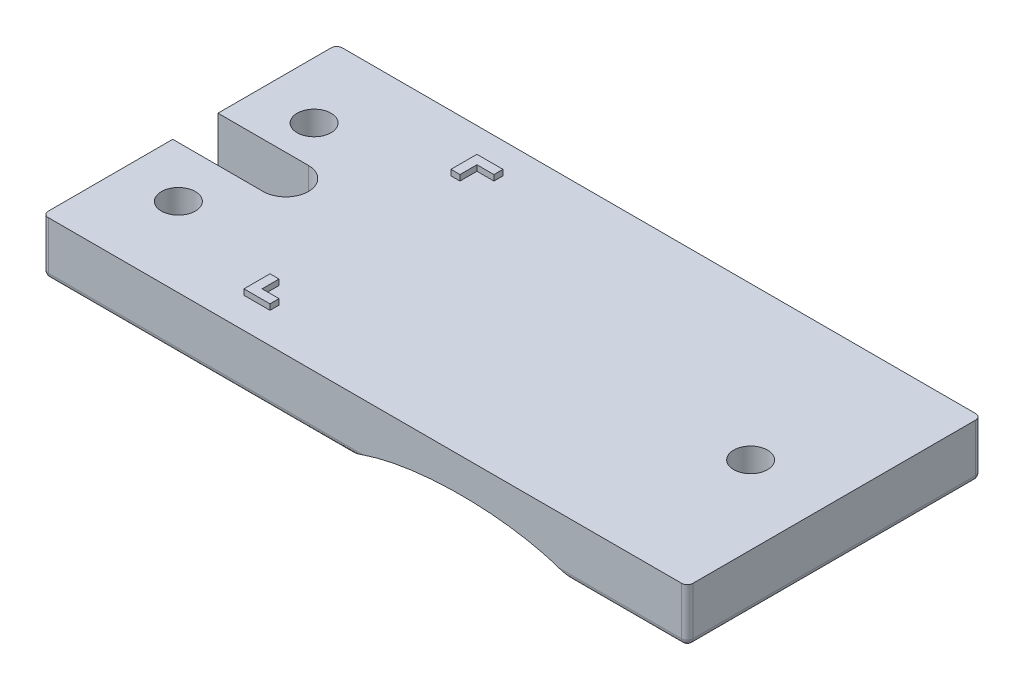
ISO-10303-21;
HEADER;
FILE_DESCRIPTION(('STEP AP214'),'2;1');
FILE_NAME('part.step','',(''),(''),'','','');
FILE_SCHEMA(('AUTOMOTIVE_DESIGN { 1 0 10303 214 1 1 1 1 }'));
ENDSEC;
DATA;
#1=APPLICATION_CONTEXT('core data for automotive mechanical design processes');
#2=APPLICATION_PROTOCOL_DEFINITION('international standard','automotive_design',2000,#1);
#3=PRODUCT_CONTEXT('',#1,'mechanical');
#4=PRODUCT('Part','Part','',(#3));
#5=PRODUCT_RELATED_PRODUCT_CATEGORY('part','',(#4));
#6=PRODUCT_DEFINITION_FORMATION('','',#4);
#7=PRODUCT_DEFINITION_CONTEXT('part definition',#1,'design');
#8=PRODUCT_DEFINITION('design','',#6,#7);
#9=PRODUCT_DEFINITION_SHAPE('','',#8);
#10=(LENGTH_UNIT() NAMED_UNIT(*) SI_UNIT(.MILLI.,.METRE.));
#11=(NAMED_UNIT(*) PLANE_ANGLE_UNIT() SI_UNIT($,.RADIAN.));
#12=(NAMED_UNIT(*) SI_UNIT($,.STERADIAN.) SOLID_ANGLE_UNIT());
#13=UNCERTAINTY_MEASURE_WITH_UNIT(LENGTH_MEASURE(1.E-05),#10,'distance_accuracy_value','');
#14=(GEOMETRIC_REPRESENTATION_CONTEXT(3) GLOBAL_UNCERTAINTY_ASSIGNED_CONTEXT((#13)) GLOBAL_UNIT_ASSIGNED_CONTEXT((#10,
#11,#12)) REPRESENTATION_CONTEXT('',''));
#15=CARTESIAN_POINT('',(0.,0.,0.));
#16=DIRECTION('',(0.,0.,1.));
#17=DIRECTION('',(1.,0.,0.));
#18=AXIS2_PLACEMENT_3D('',#15,#16,#17);
#19=CARTESIAN_POINT('',(0.,4.75,0.));
#20=DIRECTION('',(0.,1.,0.));
#21=DIRECTION('',(0.,0.,1.));
#22=AXIS2_PLACEMENT_3D('',#19,#20,#21);
#23=PLANE('',#22);
#24=DIRECTION('',(1.,0.,0.));
#25=VECTOR('',#24,1.);
#26=CARTESIAN_POINT('',(-28.6316784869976,4.75,-0.7919621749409));
#27=LINE('',#26,#25);
#28=CARTESIAN_POINT('',(-28.6316784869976,4.75,-0.7919621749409));
#29=VERTEX_POINT('',#28);
#30=CARTESIAN_POINT('',(-27.8316784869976,4.75,-0.7919621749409));
#31=VERTEX_POINT('',#30);
#32=EDGE_CURVE('E373',#29,#31,#27,.T.);
#33=ORIENTED_EDGE('',*,*,#32,.F.);
#34=DIRECTION('',(0.,0.,1.));
#35=VECTOR('',#34,1.);
#36=CARTESIAN_POINT('',(-28.6316784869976,4.75,-3.0919621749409));
#37=LINE('',#36,#35);
#38=CARTESIAN_POINT('',(-28.6316784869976,4.75,-3.0919621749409));
#39=VERTEX_POINT('',#38);
#40=EDGE_CURVE('E355',#39,#29,#37,.T.);
#41=ORIENTED_EDGE('',*,*,#40,.F.);
#42=DIRECTION('',(-1.,0.,0.));
#43=VECTOR('',#42,1.);
#44=CARTESIAN_POINT('',(-28.6316784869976,4.75,-3.0919621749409));
#45=LINE('',#44,#43);
#46=CARTESIAN_POINT('',(-26.3316784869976,4.75,-3.0919621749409));
#47=VERTEX_POINT('',#46);
#48=EDGE_CURVE('E360',#47,#39,#45,.T.);
#49=ORIENTED_EDGE('',*,*,#48,.F.);
#50=DIRECTION('',(0.,0.,-1.));
#51=VECTOR('',#50,1.);
#52=CARTESIAN_POINT('',(-26.3316784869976,4.75,-2.2919621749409));
#53=LINE('',#52,#51);
#54=CARTESIAN_POINT('',(-26.3316784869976,4.75,-2.2919621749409));
#55=VERTEX_POINT('',#54);
#56=EDGE_CURVE('E379',#55,#47,#53,.T.);
#57=ORIENTED_EDGE('',*,*,#56,.F.);
#58=DIRECTION('',(1.,0.,0.));
#59=VECTOR('',#58,1.);
#60=CARTESIAN_POINT('',(-27.8316784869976,4.75,-2.2919621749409));
#61=LINE('',#60,#59);
#62=CARTESIAN_POINT('',(-27.8316784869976,4.75,-2.2919621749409));
#63=VERTEX_POINT('',#62);
#64=EDGE_CURVE('E377',#63,#55,#61,.T.);
#65=ORIENTED_EDGE('',*,*,#64,.F.);
#66=DIRECTION('',(0.,0.,-1.));
#67=VECTOR('',#66,1.);
#68=CARTESIAN_POINT('',(-27.8316784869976,4.75,-0.7919621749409));
#69=LINE('',#68,#67);
#70=EDGE_CURVE('E375',#31,#63,#69,.T.);
#71=ORIENTED_EDGE('',*,*,#70,.F.);
#72=EDGE_LOOP('',(#33,#41,#49,#57,#65,#71));
#73=FACE_BOUND('',#72,.T.);
#74=DIRECTION('',(0.,0.,-1.));
#75=VECTOR('',#74,1.);
#76=CARTESIAN_POINT('',(13.2683215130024,4.75,-5.7919621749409));
#77=LINE('',#76,#75);
#78=CARTESIAN_POINT('',(13.2683215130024,4.75,19.7080378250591));
#79=VERTEX_POINT('',#78);
#80=CARTESIAN_POINT('',(13.2683215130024,4.75,-5.2919621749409));
#81=VERTEX_POINT('',#80);
#82=EDGE_CURVE('E558',#79,#81,#77,.T.);
#83=ORIENTED_EDGE('',*,*,#82,.T.);
#84=CARTESIAN_POINT('',(12.7683215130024,4.75,-5.2919621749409));
#85=DIRECTION('',(0.,1.,0.));
#86=DIRECTION('',(0.,0.,1.));
#87=AXIS2_PLACEMENT_3D('',#84,#85,#86);
#88=CIRCLE('',#87,0.5);
#89=CARTESIAN_POINT('',(12.7683215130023,4.75,-5.7919621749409));
#90=VERTEX_POINT('',#89);
#91=EDGE_CURVE('E795',#81,#90,#88,.T.);
#92=ORIENTED_EDGE('',*,*,#91,.T.);
#93=DIRECTION('',(-1.,0.,0.));
#94=VECTOR('',#93,1.);
#95=CARTESIAN_POINT('',(-43.7316784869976,4.75,-5.7919621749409));
#96=LINE('',#95,#94);
#97=CARTESIAN_POINT('',(-43.2316784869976,4.75,-5.7919621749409));
#98=VERTEX_POINT('',#97);
#99=EDGE_CURVE('E776',#90,#98,#96,.T.);
#100=ORIENTED_EDGE('',*,*,#99,.T.);
#101=CARTESIAN_POINT('',(-43.2316784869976,4.75,-5.2919621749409));
#102=DIRECTION('',(0.,1.,0.));
#103=DIRECTION('',(0.,0.,1.));
#104=AXIS2_PLACEMENT_3D('',#101,#102,#103);
#105=CIRCLE('',#104,0.5);
#106=CARTESIAN_POINT('',(-43.7316784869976,4.75,-5.2919621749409));
#107=VERTEX_POINT('',#106);
#108=EDGE_CURVE('E793',#98,#107,#105,.T.);
#109=ORIENTED_EDGE('',*,*,#108,.T.);
#110=DIRECTION('',(0.,0.,1.));
#111=VECTOR('',#110,1.);
#112=CARTESIAN_POINT('',(-43.7316784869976,4.75,-5.7919621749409));
#113=LINE('',#112,#111);
#114=CARTESIAN_POINT('',(-43.7316784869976,4.75,4.7080378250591));
#115=VERTEX_POINT('',#114);
#116=EDGE_CURVE('E797',#107,#115,#113,.T.);
#117=ORIENTED_EDGE('',*,*,#116,.T.);
#118=DIRECTION('',(-1.,0.,0.));
#119=VECTOR('',#118,1.);
#120=CARTESIAN_POINT('',(-35.7316784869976,4.75,4.7080378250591));
#121=LINE('',#120,#119);
#122=CARTESIAN_POINT('',(-35.7316784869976,4.75,4.7080378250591));
#123=VERTEX_POINT('',#122);
#124=EDGE_CURVE('E437',#123,#115,#121,.T.);
#125=ORIENTED_EDGE('',*,*,#124,.F.);
#126=CARTESIAN_POINT('',(-35.7316784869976,4.75,6.7080378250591));
#127=DIRECTION('',(0.,1.,0.));
#128=DIRECTION('',(0.,0.,1.));
#129=AXIS2_PLACEMENT_3D('',#126,#127,#128);
#130=CIRCLE('',#129,2.);
#131=CARTESIAN_POINT('',(-35.7316784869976,4.75,8.7080378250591));
#132=VERTEX_POINT('',#131);
#133=EDGE_CURVE('E434',#132,#123,#130,.T.);
#134=ORIENTED_EDGE('',*,*,#133,.F.);
#135=DIRECTION('',(1.,0.,0.));
#136=VECTOR('',#135,1.);
#137=CARTESIAN_POINT('',(-35.7316784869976,4.75,8.7080378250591));
#138=LINE('',#137,#136);
#139=CARTESIAN_POINT('',(-43.7316784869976,4.75,8.7080378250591));
#140=VERTEX_POINT('',#139);
#141=EDGE_CURVE('E430',#140,#132,#138,.T.);
#142=ORIENTED_EDGE('',*,*,#141,.F.);
#143=CARTESIAN_POINT('',(-43.7316784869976,4.75,19.7080378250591));
#144=VERTEX_POINT('',#143);
#145=EDGE_CURVE('E456',#140,#144,#113,.T.);
#146=ORIENTED_EDGE('',*,*,#145,.T.);
#147=CARTESIAN_POINT('',(-43.2316784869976,4.75,19.7080378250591));
#148=DIRECTION('',(0.,1.,0.));
#149=DIRECTION('',(0.,0.,1.));
#150=AXIS2_PLACEMENT_3D('',#147,#148,#149);
#151=CIRCLE('',#150,0.5);
#152=CARTESIAN_POINT('',(-43.2316784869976,4.75,20.2080378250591));
#153=VERTEX_POINT('',#152);
#154=EDGE_CURVE('E791',#144,#153,#151,.T.);
#155=ORIENTED_EDGE('',*,*,#154,.T.);
#156=DIRECTION('',(1.,0.,0.));
#157=VECTOR('',#156,1.);
#158=CARTESIAN_POINT('',(-43.7316784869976,4.75,20.2080378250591));
#159=LINE('',#158,#157);
#160=CARTESIAN_POINT('',(12.7683215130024,4.75,20.2080378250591));
#161=VERTEX_POINT('',#160);
#162=EDGE_CURVE('E802',#153,#161,#159,.T.);
#163=ORIENTED_EDGE('',*,*,#162,.T.);
#164=CARTESIAN_POINT('',(12.7683215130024,4.75,19.7080378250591));
#165=DIRECTION('',(0.,1.,0.));
#166=DIRECTION('',(0.,0.,1.));
#167=AXIS2_PLACEMENT_3D('',#164,#165,#166);
#168=CIRCLE('',#167,0.5);
#169=EDGE_CURVE('E789',#161,#79,#168,.T.);
#170=ORIENTED_EDGE('',*,*,#169,.T.);
#171=EDGE_LOOP('',(#83,#92,#100,#109,#117,#125,#134,#142,#146,#155,#163,#170));
#172=FACE_BOUND('',#171,.T.);
#173=CARTESIAN_POINT('',(6.36832151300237,4.75,7.7080378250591));
#174=DIRECTION('',(0.,-1.,0.));
#175=DIRECTION('',(0.,0.,-1.));
#176=AXIS2_PLACEMENT_3D('',#173,#174,#175);
#177=CIRCLE('',#176,1.5);
#178=CARTESIAN_POINT('',(6.36832151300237,4.75,6.20803782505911));
#179=VERTEX_POINT('',#178);
#180=EDGE_CURVE('E422',#179,#179,#177,.T.);
#181=ORIENTED_EDGE('',*,*,#180,.T.);
#182=EDGE_LOOP('',(#181));
#183=FACE_BOUND('',#182,.T.);
#184=CARTESIAN_POINT('',(-38.7316784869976,4.75,1.2080378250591));
#185=DIRECTION('',(0.,-1.,0.));
#186=DIRECTION('',(0.,0.,-1.));
#187=AXIS2_PLACEMENT_3D('',#184,#185,#186);
#188=CIRCLE('',#187,1.49999999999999);
#189=CARTESIAN_POINT('',(-38.7316784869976,4.75,-0.291962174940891));
#190=VERTEX_POINT('',#189);
#191=EDGE_CURVE('E413',#190,#190,#188,.T.);
#192=ORIENTED_EDGE('',*,*,#191,.T.);
#193=EDGE_LOOP('',(#192));
#194=FACE_BOUND('',#193,.T.);
#195=CARTESIAN_POINT('',(-38.7316784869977,4.75,13.2080378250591));
#196=DIRECTION('',(0.,-1.,0.));
#197=DIRECTION('',(0.,0.,-1.));
#198=AXIS2_PLACEMENT_3D('',#195,#196,#197);
#199=CIRCLE('',#198,1.49999999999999);
#200=CARTESIAN_POINT('',(-38.7316784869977,4.75,11.7080378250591));
#201=VERTEX_POINT('',#200);
#202=EDGE_CURVE('E404',#201,#201,#199,.T.);
#203=ORIENTED_EDGE('',*,*,#202,.T.);
#204=EDGE_LOOP('',(#203));
#205=FACE_BOUND('',#204,.T.);
#206=DIRECTION('',(0.,0.,-1.));
#207=VECTOR('',#206,1.);
#208=CARTESIAN_POINT('',(-26.3316784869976,4.75,16.7080378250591));
#209=LINE('',#208,#207);
#210=CARTESIAN_POINT('',(-26.3316784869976,4.75,17.5080378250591));
#211=VERTEX_POINT('',#210);
#212=CARTESIAN_POINT('',(-26.3316784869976,4.75,16.7080378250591));
#213=VERTEX_POINT('',#212);
#214=EDGE_CURVE('E332',#211,#213,#209,.T.);
#215=ORIENTED_EDGE('',*,*,#214,.F.);
#216=DIRECTION('',(1.,0.,0.));
#217=VECTOR('',#216,1.);
#218=CARTESIAN_POINT('',(-28.6316784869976,4.75,17.5080378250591));
#219=LINE('',#218,#217);
#220=CARTESIAN_POINT('',(-28.6316784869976,4.75,17.5080378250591));
#221=VERTEX_POINT('',#220);
#222=EDGE_CURVE('E311',#221,#211,#219,.T.);
#223=ORIENTED_EDGE('',*,*,#222,.F.);
#224=DIRECTION('',(0.,0.,1.));
#225=VECTOR('',#224,1.);
#226=CARTESIAN_POINT('',(-28.6316784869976,4.75,17.5080378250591));
#227=LINE('',#226,#225);
#228=CARTESIAN_POINT('',(-28.6316784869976,4.75,15.2080378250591));
#229=VERTEX_POINT('',#228);
#230=EDGE_CURVE('E319',#229,#221,#227,.T.);
#231=ORIENTED_EDGE('',*,*,#230,.F.);
#232=DIRECTION('',(-1.,0.,0.));
#233=VECTOR('',#232,1.);
#234=CARTESIAN_POINT('',(-28.6316784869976,4.75,15.2080378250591));
#235=LINE('',#234,#233);
#236=CARTESIAN_POINT('',(-27.8316784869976,4.75,15.2080378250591));
#237=VERTEX_POINT('',#236);
#238=EDGE_CURVE('E338',#237,#229,#235,.T.);
#239=ORIENTED_EDGE('',*,*,#238,.F.);
#240=DIRECTION('',(0.,0.,-1.));
#241=VECTOR('',#240,1.);
#242=CARTESIAN_POINT('',(-27.8316784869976,4.75,15.2080378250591));
#243=LINE('',#242,#241);
#244=CARTESIAN_POINT('',(-27.8316784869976,4.75,16.7080378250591));
#245=VERTEX_POINT('',#244);
#246=EDGE_CURVE('E336',#245,#237,#243,.T.);
#247=ORIENTED_EDGE('',*,*,#246,.F.);
#248=DIRECTION('',(-1.,0.,0.));
#249=VECTOR('',#248,1.);
#250=CARTESIAN_POINT('',(-27.8316784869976,4.75,16.7080378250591));
#251=LINE('',#250,#249);
#252=EDGE_CURVE('E334',#213,#245,#251,.T.);
#253=ORIENTED_EDGE('',*,*,#252,.F.);
#254=EDGE_LOOP('',(#215,#223,#231,#239,#247,#253));
#255=FACE_BOUND('',#254,.T.);
#256=ADVANCED_FACE('F35',(#73,#172,#183,#194,#205,#255),#23,.T.);
#257=CARTESIAN_POINT('',(-43.7316784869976,4.75,-5.7919621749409));
#258=DIRECTION('',(1.,0.,0.));
#259=DIRECTION('',(0.,0.,-1.));
#260=AXIS2_PLACEMENT_3D('',#257,#258,#259);
#261=PLANE('',#260);
#262=DIRECTION('',(0.,0.,1.));
#263=VECTOR('',#262,1.);
#264=CARTESIAN_POINT('',(-43.7316784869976,0.5,-5.7919621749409));
#265=LINE('',#264,#263);
#266=CARTESIAN_POINT('',(-43.7316784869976,0.5,8.7080378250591));
#267=VERTEX_POINT('',#266);
#268=CARTESIAN_POINT('',(-43.7316784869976,0.5,19.7080378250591));
#269=VERTEX_POINT('',#268);
#270=EDGE_CURVE('E749',#267,#269,#265,.T.);
#271=ORIENTED_EDGE('',*,*,#270,.T.);
#272=DIRECTION('',(0.,-1.,0.));
#273=VECTOR('',#272,1.);
#274=CARTESIAN_POINT('',(-43.7316784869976,4.75,19.7080378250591));
#275=LINE('',#274,#273);
#276=EDGE_CURVE('E750',#269,#144,#275,.F.);
#277=ORIENTED_EDGE('',*,*,#276,.T.);
#278=ORIENTED_EDGE('',*,*,#145,.F.);
#279=DIRECTION('',(0.,-1.,0.));
#280=VECTOR('',#279,1.);
#281=CARTESIAN_POINT('',(-43.7316784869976,4.75,8.7080378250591));
#282=LINE('',#281,#280);
#283=EDGE_CURVE('E448',#140,#267,#282,.T.);
#284=ORIENTED_EDGE('',*,*,#283,.T.);
#285=EDGE_LOOP('',(#271,#277,#278,#284));
#286=FACE_BOUND('',#285,.T.);
#287=ADVANCED_FACE('F542',(#286),#261,.F.);
#288=CARTESIAN_POINT('',(0.,0.,0.));
#289=DIRECTION('',(0.,1.,0.));
#290=DIRECTION('',(0.,0.,1.));
#291=AXIS2_PLACEMENT_3D('',#288,#289,#290);
#292=PLANE('',#291);
#293=CARTESIAN_POINT('',(6.36832151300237,0.,7.7080378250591));
#294=DIRECTION('',(0.,-1.,0.));
#295=DIRECTION('',(0.,0.,-1.));
#296=AXIS2_PLACEMENT_3D('',#293,#294,#295);
#297=CIRCLE('',#296,2.85);
#298=CARTESIAN_POINT('',(6.36832151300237,0.,4.8580378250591));
#299=VERTEX_POINT('',#298);
#300=EDGE_CURVE('E416',#299,#299,#297,.T.);
#301=ORIENTED_EDGE('',*,*,#300,.F.);
#302=EDGE_LOOP('',(#301));
#303=FACE_BOUND('',#302,.T.);
#304=DIRECTION('',(0.,0.,-1.));
#305=VECTOR('',#304,1.);
#306=CARTESIAN_POINT('',(3.27215786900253,0.,0.));
#307=LINE('',#306,#305);
#308=CARTESIAN_POINT('',(3.27215786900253,0.,19.7080378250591));
#309=VERTEX_POINT('',#308);
#310=CARTESIAN_POINT('',(3.27215786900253,0.,-5.2919621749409));
#311=VERTEX_POINT('',#310);
#312=EDGE_CURVE('E836',#309,#311,#307,.T.);
#313=ORIENTED_EDGE('',*,*,#312,.T.);
#314=DIRECTION('',(-1.,0.,0.));
#315=VECTOR('',#314,1.);
#316=CARTESIAN_POINT('',(0.,0.,-5.2919621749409));
#317=LINE('',#316,#315);
#318=CARTESIAN_POINT('',(12.7683215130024,0.,-5.2919621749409));
#319=VERTEX_POINT('',#318);
#320=EDGE_CURVE('E867',#311,#319,#317,.F.);
#321=ORIENTED_EDGE('',*,*,#320,.T.);
#322=DIRECTION('',(0.,0.,-1.));
#323=VECTOR('',#322,1.);
#324=CARTESIAN_POINT('',(12.7683215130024,0.,0.));
#325=LINE('',#324,#323);
#326=CARTESIAN_POINT('',(12.7683215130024,0.,19.7080378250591));
#327=VERTEX_POINT('',#326);
#328=EDGE_CURVE('E864',#319,#327,#325,.F.);
#329=ORIENTED_EDGE('',*,*,#328,.T.);
#330=DIRECTION('',(1.,0.,0.));
#331=VECTOR('',#330,1.);
#332=CARTESIAN_POINT('',(0.,0.,19.7080378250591));
#333=LINE('',#332,#331);
#334=EDGE_CURVE('E835',#327,#309,#333,.F.);
#335=ORIENTED_EDGE('',*,*,#334,.T.);
#336=EDGE_LOOP('',(#313,#321,#329,#335));
#337=FACE_BOUND('',#336,.T.);
#338=ADVANCED_FACE('F547',(#303,#337),#292,.F.);
#339=ORIENTED_EDGE('',*,*,#116,.F.);
#340=DIRECTION('',(0.,-1.,0.));
#341=VECTOR('',#340,1.);
#342=CARTESIAN_POINT('',(-43.7316784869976,4.75,-5.2919621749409));
#343=LINE('',#342,#341);
#344=CARTESIAN_POINT('',(-43.7316784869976,0.5,-5.2919621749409));
#345=VERTEX_POINT('',#344);
#346=EDGE_CURVE('E739',#107,#345,#343,.T.);
#347=ORIENTED_EDGE('',*,*,#346,.T.);
#348=DIRECTION('',(0.,0.,1.));
#349=VECTOR('',#348,1.);
#350=CARTESIAN_POINT('',(-43.7316784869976,0.5,-5.7919621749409));
#351=LINE('',#350,#349);
#352=CARTESIAN_POINT('',(-43.7316784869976,0.5,4.7080378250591));
#353=VERTEX_POINT('',#352);
#354=EDGE_CURVE('E678',#345,#353,#351,.T.);
#355=ORIENTED_EDGE('',*,*,#354,.T.);
#356=DIRECTION('',(0.,1.,0.));
#357=VECTOR('',#356,1.);
#358=CARTESIAN_POINT('',(-43.7316784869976,4.75,4.7080378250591));
#359=LINE('',#358,#357);
#360=EDGE_CURVE('E445',#353,#115,#359,.T.);
#361=ORIENTED_EDGE('',*,*,#360,.T.);
#362=EDGE_LOOP('',(#339,#347,#355,#361));
#363=FACE_BOUND('',#362,.T.);
#364=ADVANCED_FACE('F550',(#363),#261,.F.);
#365=CARTESIAN_POINT('',(-43.7316784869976,4.75,20.2080378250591));
#366=DIRECTION('',(0.,0.,-1.));
#367=DIRECTION('',(-1.,0.,0.));
#368=AXIS2_PLACEMENT_3D('',#365,#366,#367);
#369=PLANE('',#368);
#370=DIRECTION('',(1.,0.,0.));
#371=VECTOR('',#370,1.);
#372=CARTESIAN_POINT('',(-43.7316784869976,0.5,20.2080378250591));
#373=LINE('',#372,#371);
#374=CARTESIAN_POINT('',(1.91408512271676,0.5,20.2080378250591));
#375=VERTEX_POINT('',#374);
#376=CARTESIAN_POINT('',(12.7683215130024,0.5,20.2080378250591));
#377=VERTEX_POINT('',#376);
#378=EDGE_CURVE('E741',#375,#377,#373,.T.);
#379=ORIENTED_EDGE('',*,*,#378,.T.);
#380=DIRECTION('',(0.,-1.,0.));
#381=VECTOR('',#380,1.);
#382=CARTESIAN_POINT('',(12.7683215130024,4.75,20.2080378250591));
#383=LINE('',#382,#381);
#384=EDGE_CURVE('E747',#377,#161,#383,.F.);
#385=ORIENTED_EDGE('',*,*,#384,.T.);
#386=ORIENTED_EDGE('',*,*,#162,.F.);
#387=DIRECTION('',(0.,-1.,0.));
#388=VECTOR('',#387,1.);
#389=CARTESIAN_POINT('',(-43.2316784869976,4.75,20.2080378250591));
#390=LINE('',#389,#388);
#391=CARTESIAN_POINT('',(-43.2316784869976,0.5,20.2080378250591));
#392=VERTEX_POINT('',#391);
#393=EDGE_CURVE('E738',#153,#392,#390,.T.);
#394=ORIENTED_EDGE('',*,*,#393,.T.);
#395=DIRECTION('',(1.,0.,0.));
#396=VECTOR('',#395,1.);
#397=CARTESIAN_POINT('',(-43.7316784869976,0.5,20.2080378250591));
#398=LINE('',#397,#396);
#399=CARTESIAN_POINT('',(-15.3774420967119,0.500000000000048,20.2080378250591));
#400=VERTEX_POINT('',#399);
#401=EDGE_CURVE('E735',#392,#400,#398,.T.);
#402=ORIENTED_EDGE('',*,*,#401,.T.);
#403=CARTESIAN_POINT('',(-6.73167848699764,-2.75,20.2080378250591));
#404=DIRECTION('',(0.,0.,-1.));
#405=DIRECTION('',(-1.,0.,0.));
#406=AXIS2_PLACEMENT_3D('',#403,#404,#405);
#407=ELLIPSE('',#406,12.5,4.5);
#408=EDGE_CURVE('E452',#400,#375,#407,.T.);
#409=ORIENTED_EDGE('',*,*,#408,.T.);
#410=EDGE_LOOP('',(#379,#385,#386,#394,#402,#409));
#411=FACE_BOUND('',#410,.T.);
#412=ADVANCED_FACE('F810',(#411),#369,.F.);
#413=CARTESIAN_POINT('',(13.2683215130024,4.75,-5.7919621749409));
#414=DIRECTION('',(-1.,0.,0.));
#415=DIRECTION('',(0.,0.,1.));
#416=AXIS2_PLACEMENT_3D('',#413,#414,#415);
#417=PLANE('',#416);
#418=DIRECTION('',(0.,0.,-1.));
#419=VECTOR('',#418,1.);
#420=CARTESIAN_POINT('',(13.2683215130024,0.5,-5.7919621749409));
#421=LINE('',#420,#419);
#422=CARTESIAN_POINT('',(13.2683215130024,0.5,19.7080378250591));
#423=VERTEX_POINT('',#422);
#424=CARTESIAN_POINT('',(13.2683215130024,0.5,-5.2919621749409));
#425=VERTEX_POINT('',#424);
#426=EDGE_CURVE('E783',#423,#425,#421,.T.);
#427=ORIENTED_EDGE('',*,*,#426,.T.);
#428=DIRECTION('',(0.,-1.,0.));
#429=VECTOR('',#428,1.);
#430=CARTESIAN_POINT('',(13.2683215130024,4.75,-5.2919621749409));
#431=LINE('',#430,#429);
#432=EDGE_CURVE('E787',#425,#81,#431,.F.);
#433=ORIENTED_EDGE('',*,*,#432,.T.);
#434=ORIENTED_EDGE('',*,*,#82,.F.);
#435=DIRECTION('',(0.,-1.,0.));
#436=VECTOR('',#435,1.);
#437=CARTESIAN_POINT('',(13.2683215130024,4.75,19.7080378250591));
#438=LINE('',#437,#436);
#439=EDGE_CURVE('E785',#79,#423,#438,.T.);
#440=ORIENTED_EDGE('',*,*,#439,.T.);
#441=EDGE_LOOP('',(#427,#433,#434,#440));
#442=FACE_BOUND('',#441,.T.);
#443=ADVANCED_FACE('F819',(#442),#417,.F.);
#444=CARTESIAN_POINT('',(-43.7316784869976,4.75,-5.7919621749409));
#445=DIRECTION('',(0.,0.,1.));
#446=DIRECTION('',(1.,0.,0.));
#447=AXIS2_PLACEMENT_3D('',#444,#445,#446);
#448=PLANE('',#447);
#449=ORIENTED_EDGE('',*,*,#99,.F.);
#450=DIRECTION('',(0.,-1.,0.));
#451=VECTOR('',#450,1.);
#452=CARTESIAN_POINT('',(12.7683215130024,4.75,-5.7919621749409));
#453=LINE('',#452,#451);
#454=CARTESIAN_POINT('',(12.7683215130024,0.5,-5.7919621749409));
#455=VERTEX_POINT('',#454);
#456=EDGE_CURVE('E781',#90,#455,#453,.T.);
#457=ORIENTED_EDGE('',*,*,#456,.T.);
#458=DIRECTION('',(-1.,0.,0.));
#459=VECTOR('',#458,1.);
#460=CARTESIAN_POINT('',(-43.7316784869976,0.5,-5.7919621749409));
#461=LINE('',#460,#459);
#462=CARTESIAN_POINT('',(1.91408512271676,0.5,-5.7919621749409));
#463=VERTEX_POINT('',#462);
#464=EDGE_CURVE('E769',#455,#463,#461,.T.);
#465=ORIENTED_EDGE('',*,*,#464,.T.);
#466=CARTESIAN_POINT('',(-6.73167848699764,-2.75,-5.7919621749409));
#467=DIRECTION('',(0.,0.,-1.));
#468=DIRECTION('',(-1.,0.,0.));
#469=AXIS2_PLACEMENT_3D('',#466,#467,#468);
#470=ELLIPSE('',#469,12.5,4.5);
#471=CARTESIAN_POINT('',(-15.377442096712,0.5,-5.7919621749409));
#472=VERTEX_POINT('',#471);
#473=EDGE_CURVE('E451',#472,#463,#470,.T.);
#474=ORIENTED_EDGE('',*,*,#473,.F.);
#475=DIRECTION('',(-1.,0.,0.));
#476=VECTOR('',#475,1.);
#477=CARTESIAN_POINT('',(-43.7316784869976,0.5,-5.7919621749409));
#478=LINE('',#477,#476);
#479=CARTESIAN_POINT('',(-43.2316784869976,0.5,-5.7919621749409));
#480=VERTEX_POINT('',#479);
#481=EDGE_CURVE('E765',#472,#480,#478,.T.);
#482=ORIENTED_EDGE('',*,*,#481,.T.);
#483=DIRECTION('',(0.,-1.,0.));
#484=VECTOR('',#483,1.);
#485=CARTESIAN_POINT('',(-43.2316784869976,4.75,-5.7919621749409));
#486=LINE('',#485,#484);
#487=EDGE_CURVE('E772',#480,#98,#486,.F.);
#488=ORIENTED_EDGE('',*,*,#487,.T.);
#489=EDGE_LOOP('',(#449,#457,#465,#474,#482,#488));
#490=FACE_BOUND('',#489,.T.);
#491=ADVANCED_FACE('F764',(#490),#448,.F.);
#492=DIRECTION('',(1.,0.,0.));
#493=VECTOR('',#492,1.);
#494=CARTESIAN_POINT('',(-33.2316784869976,0.,-2.2419621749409));
#495=LINE('',#494,#493);
#496=CARTESIAN_POINT('',(-33.2316784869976,0.,-2.2419621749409));
#497=VERTEX_POINT('',#496);
#498=CARTESIAN_POINT('',(-19.2316784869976,0.,-2.2419621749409));
#499=VERTEX_POINT('',#498);
#500=EDGE_CURVE('E305',#497,#499,#495,.T.);
#501=ORIENTED_EDGE('',*,*,#500,.F.);
#502=DIRECTION('',(0.,0.,-1.));
#503=VECTOR('',#502,1.);
#504=CARTESIAN_POINT('',(-33.2316784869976,0.,-2.2419621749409));
#505=LINE('',#504,#503);
#506=CARTESIAN_POINT('',(-33.2316784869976,0.,16.7580378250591));
#507=VERTEX_POINT('',#506);
#508=EDGE_CURVE('E52',#507,#497,#505,.T.);
#509=ORIENTED_EDGE('',*,*,#508,.F.);
#510=DIRECTION('',(-1.,0.,0.));
#511=VECTOR('',#510,1.);
#512=CARTESIAN_POINT('',(-33.2316784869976,0.,16.7580378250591));
#513=LINE('',#512,#511);
#514=CARTESIAN_POINT('',(-19.2316784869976,0.,16.7580378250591));
#515=VERTEX_POINT('',#514);
#516=EDGE_CURVE('E296',#515,#507,#513,.T.);
#517=ORIENTED_EDGE('',*,*,#516,.F.);
#518=DIRECTION('',(0.,0.,1.));
#519=VECTOR('',#518,1.);
#520=CARTESIAN_POINT('',(-19.2316784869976,0.,-2.2419621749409));
#521=LINE('',#520,#519);
#522=EDGE_CURVE('E299',#499,#515,#521,.T.);
#523=ORIENTED_EDGE('',*,*,#522,.F.);
#524=EDGE_LOOP('',(#501,#509,#517,#523));
#525=FACE_BOUND('',#524,.T.);
#526=CARTESIAN_POINT('',(-38.7316784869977,0.,13.2080378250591));
#527=DIRECTION('',(0.,-1.,0.));
#528=DIRECTION('',(0.,0.,-1.));
#529=AXIS2_PLACEMENT_3D('',#526,#527,#528);
#530=CIRCLE('',#529,2.85);
#531=CARTESIAN_POINT('',(-38.7316784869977,0.,10.3580378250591));
#532=VERTEX_POINT('',#531);
#533=EDGE_CURVE('E398',#532,#532,#530,.T.);
#534=ORIENTED_EDGE('',*,*,#533,.F.);
#535=EDGE_LOOP('',(#534));
#536=FACE_BOUND('',#535,.T.);
#537=CARTESIAN_POINT('',(-38.7316784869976,0.,1.2080378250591));
#538=DIRECTION('',(0.,-1.,0.));
#539=DIRECTION('',(0.,0.,-1.));
#540=AXIS2_PLACEMENT_3D('',#537,#538,#539);
#541=CIRCLE('',#540,2.85);
#542=CARTESIAN_POINT('',(-38.7316784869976,0.,-1.6419621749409));
#543=VERTEX_POINT('',#542);
#544=EDGE_CURVE('E407',#543,#543,#541,.T.);
#545=ORIENTED_EDGE('',*,*,#544,.F.);
#546=EDGE_LOOP('',(#545));
#547=FACE_BOUND('',#546,.T.);
#548=DIRECTION('',(-1.,0.,0.));
#549=VECTOR('',#548,1.);
#550=CARTESIAN_POINT('',(-35.7316784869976,0.,4.7080378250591));
#551=LINE('',#550,#549);
#552=CARTESIAN_POINT('',(-35.7316784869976,0.,4.7080378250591));
#553=VERTEX_POINT('',#552);
#554=CARTESIAN_POINT('',(-43.2316784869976,0.,4.7080378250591));
#555=VERTEX_POINT('',#554);
#556=EDGE_CURVE('E429',#553,#555,#551,.T.);
#557=ORIENTED_EDGE('',*,*,#556,.T.);
#558=DIRECTION('',(0.,0.,1.));
#559=VECTOR('',#558,1.);
#560=CARTESIAN_POINT('',(-43.2316784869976,0.,0.));
#561=LINE('',#560,#559);
#562=CARTESIAN_POINT('',(-43.2316784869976,0.,-5.2919621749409));
#563=VERTEX_POINT('',#562);
#564=EDGE_CURVE('E680',#555,#563,#561,.F.);
#565=ORIENTED_EDGE('',*,*,#564,.T.);
#566=DIRECTION('',(-1.,0.,0.));
#567=VECTOR('',#566,1.);
#568=CARTESIAN_POINT('',(0.,0.,-5.2919621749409));
#569=LINE('',#568,#567);
#570=CARTESIAN_POINT('',(-16.7355148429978,0.,-5.2919621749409));
#571=VERTEX_POINT('',#570);
#572=EDGE_CURVE('E682',#563,#571,#569,.F.);
#573=ORIENTED_EDGE('',*,*,#572,.T.);
#574=DIRECTION('',(0.,0.,-1.));
#575=VECTOR('',#574,1.);
#576=CARTESIAN_POINT('',(-16.7355148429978,0.,0.));
#577=LINE('',#576,#575);
#578=CARTESIAN_POINT('',(-16.7355148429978,0.,19.7080378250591));
#579=VERTEX_POINT('',#578);
#580=EDGE_CURVE('E874',#571,#579,#577,.F.);
#581=ORIENTED_EDGE('',*,*,#580,.T.);
#582=DIRECTION('',(1.,0.,0.));
#583=VECTOR('',#582,1.);
#584=CARTESIAN_POINT('',(0.,0.,19.7080378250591));
#585=LINE('',#584,#583);
#586=CARTESIAN_POINT('',(-43.2316784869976,0.,19.7080378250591));
#587=VERTEX_POINT('',#586);
#588=EDGE_CURVE('E733',#579,#587,#585,.F.);
#589=ORIENTED_EDGE('',*,*,#588,.T.);
#590=DIRECTION('',(0.,0.,1.));
#591=VECTOR('',#590,1.);
#592=CARTESIAN_POINT('',(-43.2316784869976,0.,0.));
#593=LINE('',#592,#591);
#594=CARTESIAN_POINT('',(-43.2316784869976,0.,8.7080378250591));
#595=VERTEX_POINT('',#594);
#596=EDGE_CURVE('E870',#587,#595,#593,.F.);
#597=ORIENTED_EDGE('',*,*,#596,.T.);
#598=DIRECTION('',(1.,0.,0.));
#599=VECTOR('',#598,1.);
#600=CARTESIAN_POINT('',(0.,0.,8.70803782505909));
#601=LINE('',#600,#599);
#602=CARTESIAN_POINT('',(-35.7316784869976,0.,8.7080378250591));
#603=VERTEX_POINT('',#602);
#604=EDGE_CURVE('E773',#595,#603,#601,.T.);
#605=ORIENTED_EDGE('',*,*,#604,.T.);
#606=CARTESIAN_POINT('',(-35.7316784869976,0.,6.7080378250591));
#607=DIRECTION('',(0.,1.,0.));
#608=DIRECTION('',(0.,0.,1.));
#609=AXIS2_PLACEMENT_3D('',#606,#607,#608);
#610=CIRCLE('',#609,2.);
#611=EDGE_CURVE('E426',#603,#553,#610,.T.);
#612=ORIENTED_EDGE('',*,*,#611,.T.);
#613=EDGE_LOOP('',(#557,#565,#573,#581,#589,#597,#605,#612));
#614=FACE_BOUND('',#613,.T.);
#615=ADVANCED_FACE('F465',(#525,#536,#547,#614),#292,.F.);
#616=DIRECTION('',(0.,0.,-1.));
#617=VECTOR('',#616,1.);
#618=SURFACE_OF_LINEAR_EXTRUSION('',#407,#617);
#619=ORIENTED_EDGE('',*,*,#473,.T.);
#620=CARTESIAN_POINT('',(1.91408512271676,0.5,-5.7919621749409));
#621=CARTESIAN_POINT('',(1.95479724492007,0.485963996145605,-5.79195618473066));
#622=CARTESIAN_POINT('',(1.99545458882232,0.47175647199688,-5.79137061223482));
#623=CARTESIAN_POINT('',(2.07707760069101,0.442839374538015,-5.78890016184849));
#624=CARTESIAN_POINT('',(2.11804143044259,0.428125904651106,-5.78700040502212));
#625=CARTESIAN_POINT('',(2.20002692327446,0.39826251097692,-5.7817381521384));
#626=CARTESIAN_POINT('',(2.24104716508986,0.383110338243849,-5.77836602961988));
#627=CARTESIAN_POINT('',(2.32289405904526,0.352444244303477,-5.76995897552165));
#628=CARTESIAN_POINT('',(2.36372003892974,0.336929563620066,-5.76492019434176));
#629=CARTESIAN_POINT('',(2.44260547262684,0.306517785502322,-5.75327989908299));
#630=CARTESIAN_POINT('',(2.48068723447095,0.29163754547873,-5.74678685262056));
#631=CARTESIAN_POINT('',(2.55628455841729,0.261694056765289,-5.73183707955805));
#632=CARTESIAN_POINT('',(2.59380129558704,0.246631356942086,-5.72338528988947));
#633=CARTESIAN_POINT('',(2.6680570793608,0.216410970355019,-5.70414824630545));
#634=CARTESIAN_POINT('',(2.70479816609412,0.201253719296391,-5.69337026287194));
#635=CARTESIAN_POINT('',(2.77728285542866,0.170945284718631,-5.66892797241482));
#636=CARTESIAN_POINT('',(2.81302773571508,0.155794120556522,-5.65526757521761));
#637=CARTESIAN_POINT('',(2.86102136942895,0.135182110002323,-5.63397352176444));
#638=CARTESIAN_POINT('',(2.87393574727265,0.129607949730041,-5.62793873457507));
#639=CARTESIAN_POINT('',(2.89950155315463,0.118519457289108,-5.61529404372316));
#640=CARTESIAN_POINT('',(2.91215307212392,0.11300510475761,-5.60868434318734));
#641=CARTESIAN_POINT('',(2.93712563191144,0.102068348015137,-5.59482883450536));
#642=CARTESIAN_POINT('',(2.94944700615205,0.0966458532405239,-5.5875837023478));
#643=CARTESIAN_POINT('',(2.97387968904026,0.0858432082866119,-5.57225373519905));
#644=CARTESIAN_POINT('',(2.985984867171,0.0804649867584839,-5.56415771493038));
#645=CARTESIAN_POINT('',(3.00969115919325,0.0698842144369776,-5.54711236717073));
#646=CARTESIAN_POINT('',(3.02129168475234,0.0646818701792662,-5.53816208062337));
#647=CARTESIAN_POINT('',(3.04385766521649,0.0545184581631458,-5.51925136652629));
#648=CARTESIAN_POINT('',(3.05481967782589,0.0495587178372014,-5.50928614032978));
#649=CARTESIAN_POINT('',(3.06534530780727,0.0447763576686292,-5.49877473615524));
#650=B_SPLINE_CURVE_WITH_KNOTS('',3,(#620,#621,#622,#623,#624,#625,#626,#627,#628,#629,#630,
#631,#632,#633,#634,#635,#636,#637,#638,#639,#640,#641,#642,#643,#644,#645,#646,#647,#648,#649),
.UNSPECIFIED.,.F.,.F.,(4,2,2,2,2,2,2,2,2,2,2,2,2,2,4),(0.,0.129193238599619,0.259873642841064,
0.391421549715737,0.523275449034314,0.647427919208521,0.771270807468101,0.894732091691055,
1.01802697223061,1.06393455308,1.10982597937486,1.15566916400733,1.20221626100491,
1.24881624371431,1.29564779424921),.UNSPECIFIED.);
#651=CARTESIAN_POINT('',(3.06534530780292,0.0447763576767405,-5.49877473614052));
#652=VERTEX_POINT('',#651);
#653=EDGE_CURVE('E832',#463,#652,#650,.T.);
#654=ORIENTED_EDGE('',*,*,#653,.T.);
#655=DIRECTION('',(0.,0.,-1.));
#656=VECTOR('',#655,1.);
#657=CARTESIAN_POINT('',(3.06534530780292,0.0447763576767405,-5.7919621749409));
#658=LINE('',#657,#656);
#659=CARTESIAN_POINT('',(3.06534530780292,0.0447763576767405,19.9148503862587));
#660=VERTEX_POINT('',#659);
#661=EDGE_CURVE('E495',#652,#660,#658,.F.);
#662=ORIENTED_EDGE('',*,*,#661,.T.);
#663=CARTESIAN_POINT('',(3.06534530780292,0.0447763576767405,19.9148503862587));
#664=CARTESIAN_POINT('',(3.05082439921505,0.0513748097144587,19.9293241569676));
#665=CARTESIAN_POINT('',(3.03550912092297,0.0582933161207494,19.9427692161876));
#666=CARTESIAN_POINT('',(3.00373704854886,0.0725540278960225,19.967850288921));
#667=CARTESIAN_POINT('',(2.98728469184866,0.079894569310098,19.9794928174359));
#668=CARTESIAN_POINT('',(2.95378194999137,0.0947417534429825,20.0011843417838));
#669=CARTESIAN_POINT('',(2.9367415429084,0.102245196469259,20.0112513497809));
#670=CARTESIAN_POINT('',(2.90205169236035,0.117417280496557,20.0301828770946));
#671=CARTESIAN_POINT('',(2.88440155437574,0.12508610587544,20.0390459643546));
#672=CARTESIAN_POINT('',(2.82184985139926,0.152076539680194,20.0682631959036));
#673=CARTESIAN_POINT('',(2.77578181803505,0.171623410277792,20.085913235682));
#674=CARTESIAN_POINT('',(2.68212185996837,0.210669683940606,20.1165708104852));
#675=CARTESIAN_POINT('',(2.63452810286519,0.230168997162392,20.1295725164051));
#676=CARTESIAN_POINT('',(2.53768682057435,0.269157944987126,20.1521396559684));
#677=CARTESIAN_POINT('',(2.48842526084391,0.288643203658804,20.1616516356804));
#678=CARTESIAN_POINT('',(2.38924854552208,0.327189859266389,20.1776876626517));
#679=CARTESIAN_POINT('',(2.33933315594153,0.346251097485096,20.1842106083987));
#680=CARTESIAN_POINT('',(2.22654921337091,0.388579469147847,20.1960798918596));
#681=CARTESIAN_POINT('',(2.16355701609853,0.411708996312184,20.2007262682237));
#682=CARTESIAN_POINT('',(2.03843426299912,0.456684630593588,20.2066517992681));
#683=CARTESIAN_POINT('',(1.9763130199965,0.478547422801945,20.2079989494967));
#684=CARTESIAN_POINT('',(1.91408512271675,0.500000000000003,20.2080378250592));
#685=B_SPLINE_CURVE_WITH_KNOTS('',3,(#663,#664,#665,#666,#667,#668,#669,#670,#671,#672,#673,
#674,#675,#676,#677,#678,#679,#680,#681,#682,#683,#684),.UNSPECIFIED.,.F.,.F.,(4,2,2,2,2,2,2,2,
2,2,4),(0.,0.0644896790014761,0.128740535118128,0.192192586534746,0.255719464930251,
0.414531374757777,0.573541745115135,0.734895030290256,0.896307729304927,1.09800537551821,
1.29550977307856),.UNSPECIFIED.);
#686=EDGE_CURVE('E489',#660,#375,#685,.T.);
#687=ORIENTED_EDGE('',*,*,#686,.T.);
#688=ORIENTED_EDGE('',*,*,#408,.F.);
#689=CARTESIAN_POINT('',(-15.3774420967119,0.500000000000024,20.2080378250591));
#690=CARTESIAN_POINT('',(-15.4181542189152,0.485963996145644,20.2080318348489));
#691=CARTESIAN_POINT('',(-15.4588115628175,0.471756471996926,20.207446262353));
#692=CARTESIAN_POINT('',(-15.5404345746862,0.442839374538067,20.2049758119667));
#693=CARTESIAN_POINT('',(-15.5813984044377,0.428125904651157,20.2030760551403));
#694=CARTESIAN_POINT('',(-15.6633838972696,0.398262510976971,20.1978138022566));
#695=CARTESIAN_POINT('',(-15.704404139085,0.383110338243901,20.1944416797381));
#696=CARTESIAN_POINT('',(-15.7862510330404,0.35244424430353,20.1860346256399));
#697=CARTESIAN_POINT('',(-15.8270770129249,0.336929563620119,20.18099584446));
#698=CARTESIAN_POINT('',(-15.905962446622,0.306517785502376,20.1693555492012));
#699=CARTESIAN_POINT('',(-15.9440442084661,0.291637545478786,20.1628625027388));
#700=CARTESIAN_POINT('',(-16.0196415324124,0.261694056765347,20.1479127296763));
#701=CARTESIAN_POINT('',(-16.0571582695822,0.246631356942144,20.1394609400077));
#702=CARTESIAN_POINT('',(-16.1314140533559,0.216410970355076,20.1202238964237));
#703=CARTESIAN_POINT('',(-16.1681551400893,0.201253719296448,20.1094459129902));
#704=CARTESIAN_POINT('',(-16.2406398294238,0.17094528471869,20.0850036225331));
#705=CARTESIAN_POINT('',(-16.2763847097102,0.155794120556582,20.0713432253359));
#706=CARTESIAN_POINT('',(-16.3243783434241,0.135182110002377,20.0500491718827));
#707=CARTESIAN_POINT('',(-16.3372927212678,0.12960794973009,20.0440143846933));
#708=CARTESIAN_POINT('',(-16.3628585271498,0.11851945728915,20.0313696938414));
#709=CARTESIAN_POINT('',(-16.3755100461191,0.113005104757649,20.0247599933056));
#710=CARTESIAN_POINT('',(-16.4004826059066,0.102068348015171,20.0109044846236));
#711=CARTESIAN_POINT('',(-16.4128039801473,0.0966458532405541,20.003659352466));
#712=CARTESIAN_POINT('',(-16.4372366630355,0.0858432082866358,19.9883293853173));
#713=CARTESIAN_POINT('',(-16.4493418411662,0.0804649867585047,19.9802333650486));
#714=CARTESIAN_POINT('',(-16.4730481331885,0.0698842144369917,19.963188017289));
#715=CARTESIAN_POINT('',(-16.4846486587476,0.0646818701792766,19.9542377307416));
#716=CARTESIAN_POINT('',(-16.5072146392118,0.0545184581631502,19.9353270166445));
#717=CARTESIAN_POINT('',(-16.5181766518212,0.0495587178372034,19.925361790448));
#718=CARTESIAN_POINT('',(-16.5287022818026,0.04477635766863,19.9148503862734));
#719=B_SPLINE_CURVE_WITH_KNOTS('',3,(#689,#690,#691,#692,#693,#694,#695,#696,#697,#698,#699,
#700,#701,#702,#703,#704,#705,#706,#707,#708,#709,#710,#711,#712,#713,#714,#715,#716,#717,#718),
.UNSPECIFIED.,.F.,.F.,(4,2,2,2,2,2,2,2,2,2,2,2,2,2,4),(0.,0.129193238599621,0.259873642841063,
0.391421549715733,0.523275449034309,0.647427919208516,0.771270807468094,0.894732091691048,
1.0180269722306,1.06393455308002,1.10982597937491,1.1556691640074,1.202216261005,
1.24881624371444,1.29564779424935),.UNSPECIFIED.);
#720=CARTESIAN_POINT('',(-16.5287022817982,0.0447763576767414,19.9148503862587));
#721=VERTEX_POINT('',#720);
#722=EDGE_CURVE('E473',#400,#721,#719,.T.);
#723=ORIENTED_EDGE('',*,*,#722,.T.);
#724=DIRECTION('',(0.,0.,-1.));
#725=VECTOR('',#724,1.);
#726=CARTESIAN_POINT('',(-16.5287022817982,0.0447763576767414,20.2080378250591));
#727=LINE('',#726,#725);
#728=CARTESIAN_POINT('',(-16.5287022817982,0.0447763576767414,-5.49877473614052));
#729=VERTEX_POINT('',#728);
#730=EDGE_CURVE('E754',#721,#729,#727,.T.);
#731=ORIENTED_EDGE('',*,*,#730,.T.);
#732=CARTESIAN_POINT('',(-16.5287022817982,0.0447763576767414,-5.49877473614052));
#733=CARTESIAN_POINT('',(-16.5141813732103,0.0513748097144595,-5.51324850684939));
#734=CARTESIAN_POINT('',(-16.4988660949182,0.0582933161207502,-5.52669356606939));
#735=CARTESIAN_POINT('',(-16.4670940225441,0.0725540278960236,-5.55177463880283));
#736=CARTESIAN_POINT('',(-16.4506416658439,0.0798945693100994,-5.56341716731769));
#737=CARTESIAN_POINT('',(-16.4171389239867,0.094741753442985,-5.58510869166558));
#738=CARTESIAN_POINT('',(-16.4000985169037,0.102245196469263,-5.59517569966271));
#739=CARTESIAN_POINT('',(-16.3654086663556,0.11741728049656,-5.61410722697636));
#740=CARTESIAN_POINT('',(-16.347758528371,0.125086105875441,-5.62297031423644));
#741=CARTESIAN_POINT('',(-16.2852068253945,0.152076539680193,-5.65218754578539));
#742=CARTESIAN_POINT('',(-16.2391387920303,0.171623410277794,-5.66983758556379));
#743=CARTESIAN_POINT('',(-16.1454788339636,0.210669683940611,-5.70049516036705));
#744=CARTESIAN_POINT('',(-16.0978850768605,0.230168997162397,-5.71349686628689));
#745=CARTESIAN_POINT('',(-16.0010437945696,0.269157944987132,-5.73606400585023));
#746=CARTESIAN_POINT('',(-15.9517822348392,0.28864320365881,-5.74557598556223));
#747=CARTESIAN_POINT('',(-15.8526055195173,0.327189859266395,-5.76161201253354));
#748=CARTESIAN_POINT('',(-15.8026901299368,0.346251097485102,-5.76813495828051));
#749=CARTESIAN_POINT('',(-15.6899061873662,0.388579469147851,-5.78000424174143));
#750=CARTESIAN_POINT('',(-15.6269139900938,0.411708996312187,-5.78465061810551));
#751=CARTESIAN_POINT('',(-15.5017912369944,0.45668463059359,-5.79057614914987));
#752=CARTESIAN_POINT('',(-15.4396699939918,0.478547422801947,-5.79192329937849));
#753=CARTESIAN_POINT('',(-15.377442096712,0.500000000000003,-5.79196217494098));
#754=B_SPLINE_CURVE_WITH_KNOTS('',3,(#732,#733,#734,#735,#736,#737,#738,#739,#740,#741,#742,
#743,#744,#745,#746,#747,#748,#749,#750,#751,#752,#753),.UNSPECIFIED.,.F.,.F.,(4,2,2,2,2,2,2,2,
2,2,4),(0.,0.0644896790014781,0.12874053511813,0.192192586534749,0.255719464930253,
0.414531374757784,0.573541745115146,0.734895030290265,0.896307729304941,1.09800537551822,
1.29550977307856),.UNSPECIFIED.);
#755=EDGE_CURVE('E483',#729,#472,#754,.T.);
#756=ORIENTED_EDGE('',*,*,#755,.T.);
#757=EDGE_LOOP('',(#619,#654,#662,#687,#688,#723,#731,#756));
#758=FACE_BOUND('',#757,.T.);
#759=ADVANCED_FACE('F459',(#758),#618,.F.);
#760=CARTESIAN_POINT('',(-35.7316784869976,0.,8.7080378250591));
#761=DIRECTION('',(0.,0.,1.));
#762=DIRECTION('',(1.,0.,0.));
#763=AXIS2_PLACEMENT_3D('',#760,#761,#762);
#764=PLANE('',#763);
#765=ORIENTED_EDGE('',*,*,#604,.F.);
#766=CARTESIAN_POINT('',(-43.2316784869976,0.5,8.7080378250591));
#767=DIRECTION('',(0.,0.,1.));
#768=DIRECTION('',(1.,0.,0.));
#769=AXIS2_PLACEMENT_3D('',#766,#767,#768);
#770=CIRCLE('',#769,0.5);
#771=EDGE_CURVE('E11',#595,#267,#770,.F.);
#772=ORIENTED_EDGE('',*,*,#771,.T.);
#773=ORIENTED_EDGE('',*,*,#283,.F.);
#774=ORIENTED_EDGE('',*,*,#141,.T.);
#775=DIRECTION('',(0.,1.,0.));
#776=VECTOR('',#775,1.);
#777=CARTESIAN_POINT('',(-35.7316784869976,0.,8.7080378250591));
#778=LINE('',#777,#776);
#779=EDGE_CURVE('E442',#603,#132,#778,.T.);
#780=ORIENTED_EDGE('',*,*,#779,.F.);
#781=EDGE_LOOP('',(#765,#772,#773,#774,#780));
#782=FACE_BOUND('',#781,.T.);
#783=ADVANCED_FACE('F464',(#782),#764,.F.);
#784=CARTESIAN_POINT('',(-35.7316784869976,0.,4.7080378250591));
#785=DIRECTION('',(0.,0.,-1.));
#786=DIRECTION('',(-1.,0.,0.));
#787=AXIS2_PLACEMENT_3D('',#784,#785,#786);
#788=PLANE('',#787);
#789=ORIENTED_EDGE('',*,*,#360,.F.);
#790=CARTESIAN_POINT('',(-43.2316784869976,0.5,4.7080378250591));
#791=DIRECTION('',(0.,0.,-1.));
#792=DIRECTION('',(-1.,0.,0.));
#793=AXIS2_PLACEMENT_3D('',#790,#791,#792);
#794=CIRCLE('',#793,0.5);
#795=EDGE_CURVE('E44',#353,#555,#794,.F.);
#796=ORIENTED_EDGE('',*,*,#795,.T.);
#797=ORIENTED_EDGE('',*,*,#556,.F.);
#798=DIRECTION('',(0.,1.,0.));
#799=VECTOR('',#798,1.);
#800=CARTESIAN_POINT('',(-35.7316784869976,0.,4.7080378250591));
#801=LINE('',#800,#799);
#802=EDGE_CURVE('E433',#553,#123,#801,.T.);
#803=ORIENTED_EDGE('',*,*,#802,.T.);
#804=ORIENTED_EDGE('',*,*,#124,.T.);
#805=EDGE_LOOP('',(#789,#796,#797,#803,#804));
#806=FACE_BOUND('',#805,.T.);
#807=ADVANCED_FACE('F660',(#806),#788,.F.);
#808=CARTESIAN_POINT('',(-35.7316784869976,0.,6.7080378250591));
#809=DIRECTION('',(0.,1.,0.));
#810=DIRECTION('',(0.,0.,1.));
#811=AXIS2_PLACEMENT_3D('',#808,#809,#810);
#812=CYLINDRICAL_SURFACE('',#811,2.);
#813=ORIENTED_EDGE('',*,*,#133,.T.);
#814=ORIENTED_EDGE('',*,*,#802,.F.);
#815=ORIENTED_EDGE('',*,*,#611,.F.);
#816=ORIENTED_EDGE('',*,*,#779,.T.);
#817=EDGE_LOOP('',(#813,#814,#815,#816));
#818=FACE_BOUND('',#817,.T.);
#819=ADVANCED_FACE('F467',(#818),#812,.F.);
#820=CARTESIAN_POINT('',(-43.7316784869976,0.5,19.7080378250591));
#821=DIRECTION('',(1.,0.,0.));
#822=DIRECTION('',(0.,0.,-1.));
#823=AXIS2_PLACEMENT_3D('',#820,#821,#822);
#824=CYLINDRICAL_SURFACE('',#823,0.5);
#825=ORIENTED_EDGE('',*,*,#378,.F.);
#826=ORIENTED_EDGE('',*,*,#686,.F.);
#827=CARTESIAN_POINT('',(3.27215786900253,0.5,19.7080378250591));
#828=DIRECTION('',(0.707106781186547,0.,0.707106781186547));
#829=DIRECTION('',(0.707106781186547,0.,-0.707106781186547));
#830=AXIS2_PLACEMENT_3D('',#827,#828,#829);
#831=ELLIPSE('',#830,0.707106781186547,0.5);
#832=EDGE_CURVE('E438',#309,#660,#831,.F.);
#833=ORIENTED_EDGE('',*,*,#832,.F.);
#834=ORIENTED_EDGE('',*,*,#334,.F.);
#835=CARTESIAN_POINT('',(12.7683215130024,0.5,19.7080378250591));
#836=DIRECTION('',(1.,0.,0.));
#837=DIRECTION('',(0.,0.,-1.));
#838=AXIS2_PLACEMENT_3D('',#835,#836,#837);
#839=CIRCLE('',#838,0.5);
#840=EDGE_CURVE('E702',#377,#327,#839,.T.);
#841=ORIENTED_EDGE('',*,*,#840,.F.);
#842=EDGE_LOOP('',(#825,#826,#833,#834,#841));
#843=FACE_BOUND('',#842,.T.);
#844=ADVANCED_FACE('F496',(#843),#824,.T.);
#845=CARTESIAN_POINT('',(12.7683215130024,4.75,19.7080378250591));
#846=DIRECTION('',(0.,-1.,0.));
#847=DIRECTION('',(0.,0.,-1.));
#848=AXIS2_PLACEMENT_3D('',#845,#846,#847);
#849=CYLINDRICAL_SURFACE('',#848,0.5);
#850=ORIENTED_EDGE('',*,*,#169,.F.);
#851=ORIENTED_EDGE('',*,*,#384,.F.);
#852=CARTESIAN_POINT('',(12.7683215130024,0.5,19.7080378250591));
#853=DIRECTION('',(0.,-1.,0.));
#854=DIRECTION('',(0.,0.,-1.));
#855=AXIS2_PLACEMENT_3D('',#852,#853,#854);
#856=CIRCLE('',#855,0.5);
#857=EDGE_CURVE('E699',#423,#377,#856,.T.);
#858=ORIENTED_EDGE('',*,*,#857,.F.);
#859=ORIENTED_EDGE('',*,*,#439,.F.);
#860=EDGE_LOOP('',(#850,#851,#858,#859));
#861=FACE_BOUND('',#860,.T.);
#862=ADVANCED_FACE('F501',(#861),#849,.T.);
#863=CARTESIAN_POINT('',(3.27215786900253,0.500000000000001,7.2080378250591));
#864=DIRECTION('',(0.,0.,-1.));
#865=DIRECTION('',(-1.,0.,0.));
#866=AXIS2_PLACEMENT_3D('',#863,#864,#865);
#867=CYLINDRICAL_SURFACE('',#866,0.5);
#868=ORIENTED_EDGE('',*,*,#832,.T.);
#869=ORIENTED_EDGE('',*,*,#661,.F.);
#870=CARTESIAN_POINT('',(3.27215786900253,0.5,-5.2919621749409));
#871=DIRECTION('',(0.707106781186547,0.,-0.707106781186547));
#872=DIRECTION('',(-0.707106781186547,0.,-0.707106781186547));
#873=AXIS2_PLACEMENT_3D('',#870,#871,#872);
#874=ELLIPSE('',#873,0.707106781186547,0.5);
#875=EDGE_CURVE('E696',#311,#652,#874,.T.);
#876=ORIENTED_EDGE('',*,*,#875,.F.);
#877=ORIENTED_EDGE('',*,*,#312,.F.);
#878=EDGE_LOOP('',(#868,#869,#876,#877));
#879=FACE_BOUND('',#878,.T.);
#880=ADVANCED_FACE('F851',(#879),#867,.T.);
#881=CARTESIAN_POINT('',(12.7683215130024,0.5,19.7080378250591));
#882=DIRECTION('',(0.,0.,1.));
#883=DIRECTION('',(1.,0.,0.));
#884=AXIS2_PLACEMENT_3D('',#881,#882,#883);
#885=SPHERICAL_SURFACE('',#884,0.5);
#886=ORIENTED_EDGE('',*,*,#857,.T.);
#887=ORIENTED_EDGE('',*,*,#840,.T.);
#888=CARTESIAN_POINT('',(12.7683215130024,0.5,19.7080378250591));
#889=DIRECTION('',(0.,0.,1.));
#890=DIRECTION('',(1.,0.,0.));
#891=AXIS2_PLACEMENT_3D('',#888,#889,#890);
#892=CIRCLE('',#891,0.5);
#893=EDGE_CURVE('E693',#423,#327,#892,.F.);
#894=ORIENTED_EDGE('',*,*,#893,.F.);
#895=EDGE_LOOP('',(#886,#887,#894));
#896=FACE_BOUND('',#895,.T.);
#897=ADVANCED_FACE('F848',(#896),#885,.T.);
#898=CARTESIAN_POINT('',(-43.7316784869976,0.5,-5.2919621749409));
#899=DIRECTION('',(-1.,0.,0.));
#900=DIRECTION('',(0.,0.,1.));
#901=AXIS2_PLACEMENT_3D('',#898,#899,#900);
#902=CYLINDRICAL_SURFACE('',#901,0.5);
#903=ORIENTED_EDGE('',*,*,#653,.F.);
#904=ORIENTED_EDGE('',*,*,#464,.F.);
#905=CARTESIAN_POINT('',(12.7683215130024,0.5,-5.2919621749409));
#906=DIRECTION('',(1.,0.,0.));
#907=DIRECTION('',(0.,0.,-1.));
#908=AXIS2_PLACEMENT_3D('',#905,#906,#907);
#909=CIRCLE('',#908,0.5);
#910=EDGE_CURVE('E690',#319,#455,#909,.T.);
#911=ORIENTED_EDGE('',*,*,#910,.F.);
#912=ORIENTED_EDGE('',*,*,#320,.F.);
#913=ORIENTED_EDGE('',*,*,#875,.T.);
#914=EDGE_LOOP('',(#903,#904,#911,#912,#913));
#915=FACE_BOUND('',#914,.T.);
#916=ADVANCED_FACE('F831',(#915),#902,.T.);
#917=CARTESIAN_POINT('',(12.7683215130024,0.5,-5.7919621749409));
#918=DIRECTION('',(0.,0.,-1.));
#919=DIRECTION('',(-1.,0.,0.));
#920=AXIS2_PLACEMENT_3D('',#917,#918,#919);
#921=CYLINDRICAL_SURFACE('',#920,0.5);
#922=ORIENTED_EDGE('',*,*,#893,.T.);
#923=ORIENTED_EDGE('',*,*,#328,.F.);
#924=CARTESIAN_POINT('',(12.7683215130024,0.5,-5.2919621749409));
#925=DIRECTION('',(0.,0.,-1.));
#926=DIRECTION('',(-1.,0.,0.));
#927=AXIS2_PLACEMENT_3D('',#924,#925,#926);
#928=CIRCLE('',#927,0.5);
#929=EDGE_CURVE('E688',#425,#319,#928,.T.);
#930=ORIENTED_EDGE('',*,*,#929,.F.);
#931=ORIENTED_EDGE('',*,*,#426,.F.);
#932=EDGE_LOOP('',(#922,#923,#930,#931));
#933=FACE_BOUND('',#932,.T.);
#934=ADVANCED_FACE('F847',(#933),#921,.T.);
#935=CARTESIAN_POINT('',(12.7683215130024,0.5,-5.2919621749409));
#936=DIRECTION('',(0.,0.,1.));
#937=DIRECTION('',(1.,0.,0.));
#938=AXIS2_PLACEMENT_3D('',#935,#936,#937);
#939=SPHERICAL_SURFACE('',#938,0.5);
#940=ORIENTED_EDGE('',*,*,#929,.T.);
#941=ORIENTED_EDGE('',*,*,#910,.T.);
#942=CARTESIAN_POINT('',(12.7683215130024,0.5,-5.2919621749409));
#943=DIRECTION('',(0.,-1.,0.));
#944=DIRECTION('',(0.,0.,-1.));
#945=AXIS2_PLACEMENT_3D('',#942,#943,#944);
#946=CIRCLE('',#945,0.5);
#947=EDGE_CURVE('E686',#425,#455,#946,.F.);
#948=ORIENTED_EDGE('',*,*,#947,.F.);
#949=EDGE_LOOP('',(#940,#941,#948));
#950=FACE_BOUND('',#949,.T.);
#951=ADVANCED_FACE('F826',(#950),#939,.T.);
#952=CARTESIAN_POINT('',(12.7683215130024,4.75,-5.2919621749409));
#953=DIRECTION('',(0.,-1.,0.));
#954=DIRECTION('',(0.,0.,-1.));
#955=AXIS2_PLACEMENT_3D('',#952,#953,#954);
#956=CYLINDRICAL_SURFACE('',#955,0.5);
#957=ORIENTED_EDGE('',*,*,#91,.F.);
#958=ORIENTED_EDGE('',*,*,#432,.F.);
#959=ORIENTED_EDGE('',*,*,#947,.T.);
#960=ORIENTED_EDGE('',*,*,#456,.F.);
#961=EDGE_LOOP('',(#957,#958,#959,#960));
#962=FACE_BOUND('',#961,.T.);
#963=ADVANCED_FACE('F538',(#962),#956,.T.);
#964=CARTESIAN_POINT('',(-43.2316784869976,0.5,-5.7919621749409));
#965=DIRECTION('',(0.,0.,1.));
#966=DIRECTION('',(1.,0.,0.));
#967=AXIS2_PLACEMENT_3D('',#964,#965,#966);
#968=CYLINDRICAL_SURFACE('',#967,0.5);
#969=ORIENTED_EDGE('',*,*,#771,.F.);
#970=ORIENTED_EDGE('',*,*,#596,.F.);
#971=CARTESIAN_POINT('',(-43.2316784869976,0.5,19.7080378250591));
#972=DIRECTION('',(0.,0.,1.));
#973=DIRECTION('',(1.,0.,0.));
#974=AXIS2_PLACEMENT_3D('',#971,#972,#973);
#975=CIRCLE('',#974,0.5);
#976=EDGE_CURVE('E39',#269,#587,#975,.T.);
#977=ORIENTED_EDGE('',*,*,#976,.F.);
#978=ORIENTED_EDGE('',*,*,#270,.F.);
#979=EDGE_LOOP('',(#969,#970,#977,#978));
#980=FACE_BOUND('',#979,.T.);
#981=ADVANCED_FACE('F37',(#980),#968,.T.);
#982=CARTESIAN_POINT('',(-43.2316784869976,4.75,19.7080378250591));
#983=DIRECTION('',(0.,-1.,0.));
#984=DIRECTION('',(0.,0.,-1.));
#985=AXIS2_PLACEMENT_3D('',#982,#983,#984);
#986=CYLINDRICAL_SURFACE('',#985,0.5);
#987=ORIENTED_EDGE('',*,*,#154,.F.);
#988=ORIENTED_EDGE('',*,*,#276,.F.);
#989=CARTESIAN_POINT('',(-43.2316784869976,0.5,19.7080378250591));
#990=DIRECTION('',(0.,-1.,0.));
#991=DIRECTION('',(0.,0.,-1.));
#992=AXIS2_PLACEMENT_3D('',#989,#990,#991);
#993=CIRCLE('',#992,0.5);
#994=EDGE_CURVE('E722',#392,#269,#993,.T.);
#995=ORIENTED_EDGE('',*,*,#994,.F.);
#996=ORIENTED_EDGE('',*,*,#393,.F.);
#997=EDGE_LOOP('',(#987,#988,#995,#996));
#998=FACE_BOUND('',#997,.T.);
#999=ADVANCED_FACE('F531',(#998),#986,.T.);
#1000=CARTESIAN_POINT('',(-43.2316784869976,0.5,19.7080378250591));
#1001=DIRECTION('',(0.,0.,1.));
#1002=DIRECTION('',(1.,0.,0.));
#1003=AXIS2_PLACEMENT_3D('',#1000,#1001,#1002);
#1004=SPHERICAL_SURFACE('',#1003,0.5);
#1005=ORIENTED_EDGE('',*,*,#994,.T.);
#1006=ORIENTED_EDGE('',*,*,#976,.T.);
#1007=CARTESIAN_POINT('',(-43.2316784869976,0.5,19.7080378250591));
#1008=DIRECTION('',(-1.,0.,0.));
#1009=DIRECTION('',(0.,0.,1.));
#1010=AXIS2_PLACEMENT_3D('',#1007,#1008,#1009);
#1011=CIRCLE('',#1010,0.5);
#1012=EDGE_CURVE('E720',#392,#587,#1011,.F.);
#1013=ORIENTED_EDGE('',*,*,#1012,.F.);
#1014=EDGE_LOOP('',(#1005,#1006,#1013));
#1015=FACE_BOUND('',#1014,.T.);
#1016=ADVANCED_FACE('F528',(#1015),#1004,.T.);
#1017=CARTESIAN_POINT('',(-43.7316784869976,0.5,19.7080378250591));
#1018=DIRECTION('',(1.,0.,0.));
#1019=DIRECTION('',(0.,0.,-1.));
#1020=AXIS2_PLACEMENT_3D('',#1017,#1018,#1019);
#1021=CYLINDRICAL_SURFACE('',#1020,0.5);
#1022=ORIENTED_EDGE('',*,*,#1012,.T.);
#1023=ORIENTED_EDGE('',*,*,#588,.F.);
#1024=CARTESIAN_POINT('',(-16.7355148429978,0.5,19.7080378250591));
#1025=DIRECTION('',(0.707106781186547,0.,-0.707106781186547));
#1026=DIRECTION('',(0.707106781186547,0.,0.707106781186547));
#1027=AXIS2_PLACEMENT_3D('',#1024,#1025,#1026);
#1028=ELLIPSE('',#1027,0.707106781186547,0.5);
#1029=EDGE_CURVE('E717',#721,#579,#1028,.T.);
#1030=ORIENTED_EDGE('',*,*,#1029,.F.);
#1031=ORIENTED_EDGE('',*,*,#722,.F.);
#1032=ORIENTED_EDGE('',*,*,#401,.F.);
#1033=EDGE_LOOP('',(#1022,#1023,#1030,#1031,#1032));
#1034=FACE_BOUND('',#1033,.T.);
#1035=ADVANCED_FACE('F523',(#1034),#1021,.T.);
#1036=CARTESIAN_POINT('',(-16.7355148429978,0.500000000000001,7.2080378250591));
#1037=DIRECTION('',(0.,0.,-1.));
#1038=DIRECTION('',(-1.,0.,0.));
#1039=AXIS2_PLACEMENT_3D('',#1036,#1037,#1038);
#1040=CYLINDRICAL_SURFACE('',#1039,0.5);
#1041=ORIENTED_EDGE('',*,*,#1029,.T.);
#1042=ORIENTED_EDGE('',*,*,#580,.F.);
#1043=CARTESIAN_POINT('',(-16.7355148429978,0.5,-5.2919621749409));
#1044=DIRECTION('',(-0.707106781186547,0.,-0.707106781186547));
#1045=DIRECTION('',(-0.707106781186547,0.,0.707106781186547));
#1046=AXIS2_PLACEMENT_3D('',#1043,#1044,#1045);
#1047=ELLIPSE('',#1046,0.707106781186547,0.5);
#1048=EDGE_CURVE('E714',#729,#571,#1047,.T.);
#1049=ORIENTED_EDGE('',*,*,#1048,.F.);
#1050=ORIENTED_EDGE('',*,*,#730,.F.);
#1051=EDGE_LOOP('',(#1041,#1042,#1049,#1050));
#1052=FACE_BOUND('',#1051,.T.);
#1053=ADVANCED_FACE('F520',(#1052),#1040,.T.);
#1054=CARTESIAN_POINT('',(-43.2316784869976,0.5,-5.7919621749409));
#1055=DIRECTION('',(0.,0.,1.));
#1056=DIRECTION('',(1.,0.,0.));
#1057=AXIS2_PLACEMENT_3D('',#1054,#1055,#1056);
#1058=CYLINDRICAL_SURFACE('',#1057,0.5);
#1059=ORIENTED_EDGE('',*,*,#795,.F.);
#1060=ORIENTED_EDGE('',*,*,#354,.F.);
#1061=CARTESIAN_POINT('',(-43.2316784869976,0.5,-5.2919621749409));
#1062=DIRECTION('',(0.,0.,-1.));
#1063=DIRECTION('',(-1.,0.,0.));
#1064=AXIS2_PLACEMENT_3D('',#1061,#1062,#1063);
#1065=CIRCLE('',#1064,0.5);
#1066=EDGE_CURVE('E711',#563,#345,#1065,.T.);
#1067=ORIENTED_EDGE('',*,*,#1066,.F.);
#1068=ORIENTED_EDGE('',*,*,#564,.F.);
#1069=EDGE_LOOP('',(#1059,#1060,#1067,#1068));
#1070=FACE_BOUND('',#1069,.T.);
#1071=ADVANCED_FACE('F516',(#1070),#1058,.T.);
#1072=CARTESIAN_POINT('',(-43.7316784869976,0.5,-5.2919621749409));
#1073=DIRECTION('',(-1.,0.,0.));
#1074=DIRECTION('',(0.,0.,1.));
#1075=AXIS2_PLACEMENT_3D('',#1072,#1073,#1074);
#1076=CYLINDRICAL_SURFACE('',#1075,0.5);
#1077=ORIENTED_EDGE('',*,*,#1048,.T.);
#1078=ORIENTED_EDGE('',*,*,#572,.F.);
#1079=CARTESIAN_POINT('',(-43.2316784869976,0.5,-5.2919621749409));
#1080=DIRECTION('',(-1.,0.,0.));
#1081=DIRECTION('',(0.,0.,1.));
#1082=AXIS2_PLACEMENT_3D('',#1079,#1080,#1081);
#1083=CIRCLE('',#1082,0.5);
#1084=EDGE_CURVE('E708',#480,#563,#1083,.T.);
#1085=ORIENTED_EDGE('',*,*,#1084,.F.);
#1086=ORIENTED_EDGE('',*,*,#481,.F.);
#1087=ORIENTED_EDGE('',*,*,#755,.F.);
#1088=EDGE_LOOP('',(#1077,#1078,#1085,#1086,#1087));
#1089=FACE_BOUND('',#1088,.T.);
#1090=ADVANCED_FACE('F511',(#1089),#1076,.T.);
#1091=CARTESIAN_POINT('',(-43.2316784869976,0.5,-5.2919621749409));
#1092=DIRECTION('',(0.,0.,1.));
#1093=DIRECTION('',(1.,0.,0.));
#1094=AXIS2_PLACEMENT_3D('',#1091,#1092,#1093);
#1095=SPHERICAL_SURFACE('',#1094,0.5);
#1096=ORIENTED_EDGE('',*,*,#1084,.T.);
#1097=ORIENTED_EDGE('',*,*,#1066,.T.);
#1098=CARTESIAN_POINT('',(-43.2316784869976,0.5,-5.2919621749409));
#1099=DIRECTION('',(0.,-1.,0.));
#1100=DIRECTION('',(0.,0.,-1.));
#1101=AXIS2_PLACEMENT_3D('',#1098,#1099,#1100);
#1102=CIRCLE('',#1101,0.5);
#1103=EDGE_CURVE('E425',#480,#345,#1102,.F.);
#1104=ORIENTED_EDGE('',*,*,#1103,.F.);
#1105=EDGE_LOOP('',(#1096,#1097,#1104));
#1106=FACE_BOUND('',#1105,.T.);
#1107=ADVANCED_FACE('F508',(#1106),#1095,.T.);
#1108=CARTESIAN_POINT('',(-43.2316784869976,4.75,-5.2919621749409));
#1109=DIRECTION('',(0.,-1.,0.));
#1110=DIRECTION('',(0.,0.,-1.));
#1111=AXIS2_PLACEMENT_3D('',#1108,#1109,#1110);
#1112=CYLINDRICAL_SURFACE('',#1111,0.5);
#1113=ORIENTED_EDGE('',*,*,#108,.F.);
#1114=ORIENTED_EDGE('',*,*,#487,.F.);
#1115=ORIENTED_EDGE('',*,*,#1103,.T.);
#1116=ORIENTED_EDGE('',*,*,#346,.F.);
#1117=EDGE_LOOP('',(#1113,#1114,#1115,#1116));
#1118=FACE_BOUND('',#1117,.T.);
#1119=ADVANCED_FACE('F504',(#1118),#1112,.T.);
#1120=CARTESIAN_POINT('',(6.36832151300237,0.,7.7080378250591));
#1121=DIRECTION('',(0.,-1.,0.));
#1122=DIRECTION('',(0.,0.,-1.));
#1123=AXIS2_PLACEMENT_3D('',#1120,#1121,#1122);
#1124=CYLINDRICAL_SURFACE('',#1123,1.5);
#1125=ORIENTED_EDGE('',*,*,#180,.F.);
#1126=EDGE_LOOP('',(#1125));
#1127=FACE_BOUND('',#1126,.T.);
#1128=CARTESIAN_POINT('',(6.36832151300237,1.35,7.7080378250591));
#1129=DIRECTION('',(0.,-1.,0.));
#1130=DIRECTION('',(0.,0.,-1.));
#1131=AXIS2_PLACEMENT_3D('',#1128,#1129,#1130);
#1132=CIRCLE('',#1131,1.5);
#1133=CARTESIAN_POINT('',(6.36832151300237,1.35,6.20803782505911));
#1134=VERTEX_POINT('',#1133);
#1135=EDGE_CURVE('E419',#1134,#1134,#1132,.T.);
#1136=ORIENTED_EDGE('',*,*,#1135,.T.);
#1137=EDGE_LOOP('',(#1136));
#1138=FACE_BOUND('',#1137,.T.);
#1139=ADVANCED_FACE('F507',(#1127,#1138),#1124,.F.);
#1140=CARTESIAN_POINT('',(6.36832151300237,0.,7.7080378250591));
#1141=DIRECTION('',(0.,-1.,0.));
#1142=DIRECTION('',(0.,0.,-1.));
#1143=AXIS2_PLACEMENT_3D('',#1140,#1141,#1142);
#1144=CONICAL_SURFACE('',#1143,2.85,0.785398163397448);
#1145=ORIENTED_EDGE('',*,*,#1135,.F.);
#1146=EDGE_LOOP('',(#1145));
#1147=FACE_BOUND('',#1146,.T.);
#1148=ORIENTED_EDGE('',*,*,#300,.T.);
#1149=EDGE_LOOP('',(#1148));
#1150=FACE_BOUND('',#1149,.T.);
#1151=ADVANCED_FACE('F651',(#1147,#1150),#1144,.F.);
#1152=CARTESIAN_POINT('',(-38.7316784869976,0.,1.2080378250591));
#1153=DIRECTION('',(0.,-1.,0.));
#1154=DIRECTION('',(0.,0.,-1.));
#1155=AXIS2_PLACEMENT_3D('',#1152,#1153,#1154);
#1156=CYLINDRICAL_SURFACE('',#1155,1.49999999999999);
#1157=ORIENTED_EDGE('',*,*,#191,.F.);
#1158=EDGE_LOOP('',(#1157));
#1159=FACE_BOUND('',#1158,.T.);
#1160=CARTESIAN_POINT('',(-38.7316784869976,1.35,1.2080378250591));
#1161=DIRECTION('',(0.,-1.,0.));
#1162=DIRECTION('',(0.,0.,-1.));
#1163=AXIS2_PLACEMENT_3D('',#1160,#1161,#1162);
#1164=CIRCLE('',#1163,1.49999999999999);
#1165=CARTESIAN_POINT('',(-38.7316784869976,1.35,-0.291962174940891));
#1166=VERTEX_POINT('',#1165);
#1167=EDGE_CURVE('E410',#1166,#1166,#1164,.T.);
#1168=ORIENTED_EDGE('',*,*,#1167,.T.);
#1169=EDGE_LOOP('',(#1168));
#1170=FACE_BOUND('',#1169,.T.);
#1171=ADVANCED_FACE('F647',(#1159,#1170),#1156,.F.);
#1172=CARTESIAN_POINT('',(-38.7316784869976,0.,1.2080378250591));
#1173=DIRECTION('',(0.,-1.,0.));
#1174=DIRECTION('',(0.,0.,-1.));
#1175=AXIS2_PLACEMENT_3D('',#1172,#1173,#1174);
#1176=CONICAL_SURFACE('',#1175,2.85,0.785398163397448);
#1177=ORIENTED_EDGE('',*,*,#1167,.F.);
#1178=EDGE_LOOP('',(#1177));
#1179=FACE_BOUND('',#1178,.T.);
#1180=ORIENTED_EDGE('',*,*,#544,.T.);
#1181=EDGE_LOOP('',(#1180));
#1182=FACE_BOUND('',#1181,.T.);
#1183=ADVANCED_FACE('F643',(#1179,#1182),#1176,.F.);
#1184=CARTESIAN_POINT('',(-38.7316784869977,0.,13.2080378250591));
#1185=DIRECTION('',(0.,-1.,0.));
#1186=DIRECTION('',(0.,0.,-1.));
#1187=AXIS2_PLACEMENT_3D('',#1184,#1185,#1186);
#1188=CYLINDRICAL_SURFACE('',#1187,1.49999999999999);
#1189=ORIENTED_EDGE('',*,*,#202,.F.);
#1190=EDGE_LOOP('',(#1189));
#1191=FACE_BOUND('',#1190,.T.);
#1192=CARTESIAN_POINT('',(-38.7316784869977,1.35,13.2080378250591));
#1193=DIRECTION('',(0.,-1.,0.));
#1194=DIRECTION('',(0.,0.,-1.));
#1195=AXIS2_PLACEMENT_3D('',#1192,#1193,#1194);
#1196=CIRCLE('',#1195,1.49999999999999);
#1197=CARTESIAN_POINT('',(-38.7316784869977,1.35,11.7080378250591));
#1198=VERTEX_POINT('',#1197);
#1199=EDGE_CURVE('E401',#1198,#1198,#1196,.T.);
#1200=ORIENTED_EDGE('',*,*,#1199,.T.);
#1201=EDGE_LOOP('',(#1200));
#1202=FACE_BOUND('',#1201,.T.);
#1203=ADVANCED_FACE('F639',(#1191,#1202),#1188,.F.);
#1204=CARTESIAN_POINT('',(-38.7316784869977,0.,13.2080378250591));
#1205=DIRECTION('',(0.,-1.,0.));
#1206=DIRECTION('',(0.,0.,-1.));
#1207=AXIS2_PLACEMENT_3D('',#1204,#1205,#1206);
#1208=CONICAL_SURFACE('',#1207,2.85,0.785398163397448);
#1209=ORIENTED_EDGE('',*,*,#1199,.F.);
#1210=EDGE_LOOP('',(#1209));
#1211=FACE_BOUND('',#1210,.T.);
#1212=ORIENTED_EDGE('',*,*,#533,.T.);
#1213=EDGE_LOOP('',(#1212));
#1214=FACE_BOUND('',#1213,.T.);
#1215=ADVANCED_FACE('F635',(#1211,#1214),#1208,.F.);
#1216=CARTESIAN_POINT('',(-28.6316784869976,5.25,-3.0919621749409));
#1217=DIRECTION('',(1.,0.,0.));
#1218=DIRECTION('',(0.,0.,-1.));
#1219=AXIS2_PLACEMENT_3D('',#1216,#1217,#1218);
#1220=PLANE('',#1219);
#1221=ORIENTED_EDGE('',*,*,#40,.T.);
#1222=DIRECTION('',(0.,-1.,0.));
#1223=VECTOR('',#1222,1.);
#1224=CARTESIAN_POINT('',(-28.6316784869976,5.25,-0.7919621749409));
#1225=LINE('',#1224,#1223);
#1226=CARTESIAN_POINT('',(-28.6316784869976,5.25,-0.7919621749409));
#1227=VERTEX_POINT('',#1226);
#1228=EDGE_CURVE('E396',#1227,#29,#1225,.T.);
#1229=ORIENTED_EDGE('',*,*,#1228,.F.);
#1230=DIRECTION('',(0.,0.,1.));
#1231=VECTOR('',#1230,1.);
#1232=CARTESIAN_POINT('',(-28.6316784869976,5.25,-3.0919621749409));
#1233=LINE('',#1232,#1231);
#1234=CARTESIAN_POINT('',(-28.6316784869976,5.25,-3.0919621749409));
#1235=VERTEX_POINT('',#1234);
#1236=EDGE_CURVE('E356',#1235,#1227,#1233,.T.);
#1237=ORIENTED_EDGE('',*,*,#1236,.F.);
#1238=DIRECTION('',(0.,-1.,0.));
#1239=VECTOR('',#1238,1.);
#1240=CARTESIAN_POINT('',(-28.6316784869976,5.25,-3.0919621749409));
#1241=LINE('',#1240,#1239);
#1242=EDGE_CURVE('E370',#1235,#39,#1241,.T.);
#1243=ORIENTED_EDGE('',*,*,#1242,.T.);
#1244=EDGE_LOOP('',(#1221,#1229,#1237,#1243));
#1245=FACE_BOUND('',#1244,.T.);
#1246=ADVANCED_FACE('F631',(#1245),#1220,.F.);
#1247=CARTESIAN_POINT('',(-28.6316784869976,5.25,-0.7919621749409));
#1248=DIRECTION('',(0.,0.,-1.));
#1249=DIRECTION('',(-1.,0.,0.));
#1250=AXIS2_PLACEMENT_3D('',#1247,#1248,#1249);
#1251=PLANE('',#1250);
#1252=ORIENTED_EDGE('',*,*,#32,.T.);
#1253=DIRECTION('',(0.,-1.,0.));
#1254=VECTOR('',#1253,1.);
#1255=CARTESIAN_POINT('',(-27.8316784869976,5.25,-0.7919621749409));
#1256=LINE('',#1255,#1254);
#1257=CARTESIAN_POINT('',(-27.8316784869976,5.25,-0.7919621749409));
#1258=VERTEX_POINT('',#1257);
#1259=EDGE_CURVE('E393',#1258,#31,#1256,.T.);
#1260=ORIENTED_EDGE('',*,*,#1259,.F.);
#1261=DIRECTION('',(1.,0.,0.));
#1262=VECTOR('',#1261,1.);
#1263=CARTESIAN_POINT('',(-28.6316784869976,5.25,-0.7919621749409));
#1264=LINE('',#1263,#1262);
#1265=EDGE_CURVE('E359',#1227,#1258,#1264,.T.);
#1266=ORIENTED_EDGE('',*,*,#1265,.F.);
#1267=ORIENTED_EDGE('',*,*,#1228,.T.);
#1268=EDGE_LOOP('',(#1252,#1260,#1266,#1267));
#1269=FACE_BOUND('',#1268,.T.);
#1270=ADVANCED_FACE('F627',(#1269),#1251,.F.);
#1271=CARTESIAN_POINT('',(-27.8316784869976,5.25,-0.7919621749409));
#1272=DIRECTION('',(-1.,0.,0.));
#1273=DIRECTION('',(0.,0.,1.));
#1274=AXIS2_PLACEMENT_3D('',#1271,#1272,#1273);
#1275=PLANE('',#1274);
#1276=ORIENTED_EDGE('',*,*,#70,.T.);
#1277=DIRECTION('',(0.,-1.,0.));
#1278=VECTOR('',#1277,1.);
#1279=CARTESIAN_POINT('',(-27.8316784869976,5.25,-2.2919621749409));
#1280=LINE('',#1279,#1278);
#1281=CARTESIAN_POINT('',(-27.8316784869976,5.25,-2.2919621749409));
#1282=VERTEX_POINT('',#1281);
#1283=EDGE_CURVE('E390',#1282,#63,#1280,.T.);
#1284=ORIENTED_EDGE('',*,*,#1283,.F.);
#1285=DIRECTION('',(0.,0.,-1.));
#1286=VECTOR('',#1285,1.);
#1287=CARTESIAN_POINT('',(-27.8316784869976,5.25,-0.7919621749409));
#1288=LINE('',#1287,#1286);
#1289=EDGE_CURVE('E362',#1258,#1282,#1288,.T.);
#1290=ORIENTED_EDGE('',*,*,#1289,.F.);
#1291=ORIENTED_EDGE('',*,*,#1259,.T.);
#1292=EDGE_LOOP('',(#1276,#1284,#1290,#1291));
#1293=FACE_BOUND('',#1292,.T.);
#1294=ADVANCED_FACE('F623',(#1293),#1275,.F.);
#1295=CARTESIAN_POINT('',(-27.8316784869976,5.25,-2.2919621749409));
#1296=DIRECTION('',(0.,0.,-1.));
#1297=DIRECTION('',(-1.,0.,0.));
#1298=AXIS2_PLACEMENT_3D('',#1295,#1296,#1297);
#1299=PLANE('',#1298);
#1300=ORIENTED_EDGE('',*,*,#64,.T.);
#1301=DIRECTION('',(0.,-1.,0.));
#1302=VECTOR('',#1301,1.);
#1303=CARTESIAN_POINT('',(-26.3316784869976,5.25,-2.2919621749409));
#1304=LINE('',#1303,#1302);
#1305=CARTESIAN_POINT('',(-26.3316784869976,5.25,-2.2919621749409));
#1306=VERTEX_POINT('',#1305);
#1307=EDGE_CURVE('E387',#1306,#55,#1304,.T.);
#1308=ORIENTED_EDGE('',*,*,#1307,.F.);
#1309=DIRECTION('',(1.,0.,0.));
#1310=VECTOR('',#1309,1.);
#1311=CARTESIAN_POINT('',(-27.8316784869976,5.25,-2.2919621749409));
#1312=LINE('',#1311,#1310);
#1313=EDGE_CURVE('E364',#1282,#1306,#1312,.T.);
#1314=ORIENTED_EDGE('',*,*,#1313,.F.);
#1315=ORIENTED_EDGE('',*,*,#1283,.T.);
#1316=EDGE_LOOP('',(#1300,#1308,#1314,#1315));
#1317=FACE_BOUND('',#1316,.T.);
#1318=ADVANCED_FACE('F619',(#1317),#1299,.F.);
#1319=CARTESIAN_POINT('',(-26.3316784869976,5.25,-2.2919621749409));
#1320=DIRECTION('',(-1.,0.,0.));
#1321=DIRECTION('',(0.,0.,1.));
#1322=AXIS2_PLACEMENT_3D('',#1319,#1320,#1321);
#1323=PLANE('',#1322);
#1324=ORIENTED_EDGE('',*,*,#56,.T.);
#1325=DIRECTION('',(0.,-1.,0.));
#1326=VECTOR('',#1325,1.);
#1327=CARTESIAN_POINT('',(-26.3316784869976,5.25,-3.0919621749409));
#1328=LINE('',#1327,#1326);
#1329=CARTESIAN_POINT('',(-26.3316784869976,5.25,-3.0919621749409));
#1330=VERTEX_POINT('',#1329);
#1331=EDGE_CURVE('E385',#1330,#47,#1328,.T.);
#1332=ORIENTED_EDGE('',*,*,#1331,.F.);
#1333=DIRECTION('',(0.,0.,-1.));
#1334=VECTOR('',#1333,1.);
#1335=CARTESIAN_POINT('',(-26.3316784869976,5.25,-2.2919621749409));
#1336=LINE('',#1335,#1334);
#1337=EDGE_CURVE('E366',#1306,#1330,#1336,.T.);
#1338=ORIENTED_EDGE('',*,*,#1337,.F.);
#1339=ORIENTED_EDGE('',*,*,#1307,.T.);
#1340=EDGE_LOOP('',(#1324,#1332,#1338,#1339));
#1341=FACE_BOUND('',#1340,.T.);
#1342=ADVANCED_FACE('F615',(#1341),#1323,.F.);
#1343=CARTESIAN_POINT('',(-28.6316784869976,5.25,-3.0919621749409));
#1344=DIRECTION('',(0.,0.,1.));
#1345=DIRECTION('',(1.,0.,0.));
#1346=AXIS2_PLACEMENT_3D('',#1343,#1344,#1345);
#1347=PLANE('',#1346);
#1348=ORIENTED_EDGE('',*,*,#48,.T.);
#1349=ORIENTED_EDGE('',*,*,#1242,.F.);
#1350=DIRECTION('',(-1.,0.,0.));
#1351=VECTOR('',#1350,1.);
#1352=CARTESIAN_POINT('',(-28.6316784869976,5.25,-3.0919621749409));
#1353=LINE('',#1352,#1351);
#1354=EDGE_CURVE('E368',#1330,#1235,#1353,.T.);
#1355=ORIENTED_EDGE('',*,*,#1354,.F.);
#1356=ORIENTED_EDGE('',*,*,#1331,.T.);
#1357=EDGE_LOOP('',(#1348,#1349,#1355,#1356));
#1358=FACE_BOUND('',#1357,.T.);
#1359=ADVANCED_FACE('F611',(#1358),#1347,.F.);
#1360=CARTESIAN_POINT('',(0.,5.25,0.));
#1361=DIRECTION('',(0.,1.,0.));
#1362=DIRECTION('',(0.,0.,1.));
#1363=AXIS2_PLACEMENT_3D('',#1360,#1361,#1362);
#1364=PLANE('',#1363);
#1365=ORIENTED_EDGE('',*,*,#1236,.T.);
#1366=ORIENTED_EDGE('',*,*,#1265,.T.);
#1367=ORIENTED_EDGE('',*,*,#1289,.T.);
#1368=ORIENTED_EDGE('',*,*,#1313,.T.);
#1369=ORIENTED_EDGE('',*,*,#1337,.T.);
#1370=ORIENTED_EDGE('',*,*,#1354,.T.);
#1371=EDGE_LOOP('',(#1365,#1366,#1367,#1368,#1369,#1370));
#1372=FACE_BOUND('',#1371,.T.);
#1373=ADVANCED_FACE('F608',(#1372),#1364,.T.);
#1374=CARTESIAN_POINT('',(-28.6316784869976,5.25,17.5080378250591));
#1375=DIRECTION('',(0.,0.,-1.));
#1376=DIRECTION('',(-1.,0.,0.));
#1377=AXIS2_PLACEMENT_3D('',#1374,#1375,#1376);
#1378=PLANE('',#1377);
#1379=ORIENTED_EDGE('',*,*,#222,.T.);
#1380=DIRECTION('',(0.,-1.,0.));
#1381=VECTOR('',#1380,1.);
#1382=CARTESIAN_POINT('',(-26.3316784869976,5.25,17.5080378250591));
#1383=LINE('',#1382,#1381);
#1384=CARTESIAN_POINT('',(-26.3316784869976,5.25,17.5080378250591));
#1385=VERTEX_POINT('',#1384);
#1386=EDGE_CURVE('E353',#1385,#211,#1383,.T.);
#1387=ORIENTED_EDGE('',*,*,#1386,.F.);
#1388=DIRECTION('',(1.,0.,0.));
#1389=VECTOR('',#1388,1.);
#1390=CARTESIAN_POINT('',(-28.6316784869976,5.25,17.5080378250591));
#1391=LINE('',#1390,#1389);
#1392=CARTESIAN_POINT('',(-28.6316784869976,5.25,17.5080378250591));
#1393=VERTEX_POINT('',#1392);
#1394=EDGE_CURVE('E315',#1393,#1385,#1391,.T.);
#1395=ORIENTED_EDGE('',*,*,#1394,.F.);
#1396=DIRECTION('',(0.,-1.,0.));
#1397=VECTOR('',#1396,1.);
#1398=CARTESIAN_POINT('',(-28.6316784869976,5.25,17.5080378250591));
#1399=LINE('',#1398,#1397);
#1400=EDGE_CURVE('E329',#1393,#221,#1399,.T.);
#1401=ORIENTED_EDGE('',*,*,#1400,.T.);
#1402=EDGE_LOOP('',(#1379,#1387,#1395,#1401));
#1403=FACE_BOUND('',#1402,.T.);
#1404=ADVANCED_FACE('F586',(#1403),#1378,.F.);
#1405=CARTESIAN_POINT('',(-26.3316784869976,5.25,16.7080378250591));
#1406=DIRECTION('',(-1.,0.,0.));
#1407=DIRECTION('',(0.,0.,1.));
#1408=AXIS2_PLACEMENT_3D('',#1405,#1406,#1407);
#1409=PLANE('',#1408);
#1410=ORIENTED_EDGE('',*,*,#214,.T.);
#1411=DIRECTION('',(0.,-1.,0.));
#1412=VECTOR('',#1411,1.);
#1413=CARTESIAN_POINT('',(-26.3316784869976,5.25,16.7080378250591));
#1414=LINE('',#1413,#1412);
#1415=CARTESIAN_POINT('',(-26.3316784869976,5.25,16.7080378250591));
#1416=VERTEX_POINT('',#1415);
#1417=EDGE_CURVE('E350',#1416,#213,#1414,.T.);
#1418=ORIENTED_EDGE('',*,*,#1417,.F.);
#1419=DIRECTION('',(0.,0.,-1.));
#1420=VECTOR('',#1419,1.);
#1421=CARTESIAN_POINT('',(-26.3316784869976,5.25,16.7080378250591));
#1422=LINE('',#1421,#1420);
#1423=EDGE_CURVE('E318',#1385,#1416,#1422,.T.);
#1424=ORIENTED_EDGE('',*,*,#1423,.F.);
#1425=ORIENTED_EDGE('',*,*,#1386,.T.);
#1426=EDGE_LOOP('',(#1410,#1418,#1424,#1425));
#1427=FACE_BOUND('',#1426,.T.);
#1428=ADVANCED_FACE('F573',(#1427),#1409,.F.);
#1429=CARTESIAN_POINT('',(-27.8316784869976,5.25,16.7080378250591));
#1430=DIRECTION('',(0.,0.,1.));
#1431=DIRECTION('',(1.,0.,0.));
#1432=AXIS2_PLACEMENT_3D('',#1429,#1430,#1431);
#1433=PLANE('',#1432);
#1434=ORIENTED_EDGE('',*,*,#252,.T.);
#1435=DIRECTION('',(0.,-1.,0.));
#1436=VECTOR('',#1435,1.);
#1437=CARTESIAN_POINT('',(-27.8316784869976,5.25,16.7080378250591));
#1438=LINE('',#1437,#1436);
#1439=CARTESIAN_POINT('',(-27.8316784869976,5.25,16.7080378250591));
#1440=VERTEX_POINT('',#1439);
#1441=EDGE_CURVE('E347',#1440,#245,#1438,.T.);
#1442=ORIENTED_EDGE('',*,*,#1441,.F.);
#1443=DIRECTION('',(-1.,0.,0.));
#1444=VECTOR('',#1443,1.);
#1445=CARTESIAN_POINT('',(-27.8316784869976,5.25,16.7080378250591));
#1446=LINE('',#1445,#1444);
#1447=EDGE_CURVE('E321',#1416,#1440,#1446,.T.);
#1448=ORIENTED_EDGE('',*,*,#1447,.F.);
#1449=ORIENTED_EDGE('',*,*,#1417,.T.);
#1450=EDGE_LOOP('',(#1434,#1442,#1448,#1449));
#1451=FACE_BOUND('',#1450,.T.);
#1452=ADVANCED_FACE('F577',(#1451),#1433,.F.);
#1453=CARTESIAN_POINT('',(-27.8316784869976,5.25,15.2080378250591));
#1454=DIRECTION('',(-1.,0.,0.));
#1455=DIRECTION('',(0.,0.,1.));
#1456=AXIS2_PLACEMENT_3D('',#1453,#1454,#1455);
#1457=PLANE('',#1456);
#1458=ORIENTED_EDGE('',*,*,#246,.T.);
#1459=DIRECTION('',(0.,-1.,0.));
#1460=VECTOR('',#1459,1.);
#1461=CARTESIAN_POINT('',(-27.8316784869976,5.25,15.2080378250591));
#1462=LINE('',#1461,#1460);
#1463=CARTESIAN_POINT('',(-27.8316784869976,5.25,15.2080378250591));
#1464=VERTEX_POINT('',#1463);
#1465=EDGE_CURVE('E344',#1464,#237,#1462,.T.);
#1466=ORIENTED_EDGE('',*,*,#1465,.F.);
#1467=DIRECTION('',(0.,0.,-1.));
#1468=VECTOR('',#1467,1.);
#1469=CARTESIAN_POINT('',(-27.8316784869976,5.25,15.2080378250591));
#1470=LINE('',#1469,#1468);
#1471=EDGE_CURVE('E323',#1440,#1464,#1470,.T.);
#1472=ORIENTED_EDGE('',*,*,#1471,.F.);
#1473=ORIENTED_EDGE('',*,*,#1441,.T.);
#1474=EDGE_LOOP('',(#1458,#1466,#1472,#1473));
#1475=FACE_BOUND('',#1474,.T.);
#1476=ADVANCED_FACE('F593',(#1475),#1457,.F.);
#1477=CARTESIAN_POINT('',(-28.6316784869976,5.25,15.2080378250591));
#1478=DIRECTION('',(0.,0.,1.));
#1479=DIRECTION('',(1.,0.,0.));
#1480=AXIS2_PLACEMENT_3D('',#1477,#1478,#1479);
#1481=PLANE('',#1480);
#1482=ORIENTED_EDGE('',*,*,#238,.T.);
#1483=DIRECTION('',(0.,-1.,0.));
#1484=VECTOR('',#1483,1.);
#1485=CARTESIAN_POINT('',(-28.6316784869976,5.25,15.2080378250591));
#1486=LINE('',#1485,#1484);
#1487=CARTESIAN_POINT('',(-28.6316784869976,5.25,15.2080378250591));
#1488=VERTEX_POINT('',#1487);
#1489=EDGE_CURVE('E60',#1488,#229,#1486,.T.);
#1490=ORIENTED_EDGE('',*,*,#1489,.F.);
#1491=DIRECTION('',(-1.,0.,0.));
#1492=VECTOR('',#1491,1.);
#1493=CARTESIAN_POINT('',(-28.6316784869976,5.25,15.2080378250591));
#1494=LINE('',#1493,#1492);
#1495=EDGE_CURVE('E325',#1464,#1488,#1494,.T.);
#1496=ORIENTED_EDGE('',*,*,#1495,.F.);
#1497=ORIENTED_EDGE('',*,*,#1465,.T.);
#1498=EDGE_LOOP('',(#1482,#1490,#1496,#1497));
#1499=FACE_BOUND('',#1498,.T.);
#1500=ADVANCED_FACE('F590',(#1499),#1481,.F.);
#1501=CARTESIAN_POINT('',(-28.6316784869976,5.25,17.5080378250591));
#1502=DIRECTION('',(1.,0.,0.));
#1503=DIRECTION('',(0.,0.,-1.));
#1504=AXIS2_PLACEMENT_3D('',#1501,#1502,#1503);
#1505=PLANE('',#1504);
#1506=ORIENTED_EDGE('',*,*,#230,.T.);
#1507=ORIENTED_EDGE('',*,*,#1400,.F.);
#1508=DIRECTION('',(0.,0.,1.));
#1509=VECTOR('',#1508,1.);
#1510=CARTESIAN_POINT('',(-28.6316784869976,5.25,17.5080378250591));
#1511=LINE('',#1510,#1509);
#1512=EDGE_CURVE('E327',#1488,#1393,#1511,.T.);
#1513=ORIENTED_EDGE('',*,*,#1512,.F.);
#1514=ORIENTED_EDGE('',*,*,#1489,.T.);
#1515=EDGE_LOOP('',(#1506,#1507,#1513,#1514));
#1516=FACE_BOUND('',#1515,.T.);
#1517=ADVANCED_FACE('F587',(#1516),#1505,.F.);
#1518=CARTESIAN_POINT('',(0.,5.25,0.));
#1519=DIRECTION('',(0.,-1.,0.));
#1520=DIRECTION('',(0.,0.,-1.));
#1521=AXIS2_PLACEMENT_3D('',#1518,#1519,#1520);
#1522=PLANE('',#1521);
#1523=ORIENTED_EDGE('',*,*,#1394,.T.);
#1524=ORIENTED_EDGE('',*,*,#1423,.T.);
#1525=ORIENTED_EDGE('',*,*,#1447,.T.);
#1526=ORIENTED_EDGE('',*,*,#1471,.T.);
#1527=ORIENTED_EDGE('',*,*,#1495,.T.);
#1528=ORIENTED_EDGE('',*,*,#1512,.T.);
#1529=EDGE_LOOP('',(#1523,#1524,#1525,#1526,#1527,#1528));
#1530=FACE_BOUND('',#1529,.T.);
#1531=ADVANCED_FACE('F581',(#1530),#1522,.F.);
#1532=CARTESIAN_POINT('',(-33.2316784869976,1.,-2.2419621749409));
#1533=DIRECTION('',(-1.,0.,0.));
#1534=DIRECTION('',(0.,0.,1.));
#1535=AXIS2_PLACEMENT_3D('',#1532,#1533,#1534);
#1536=PLANE('',#1535);
#1537=ORIENTED_EDGE('',*,*,#508,.T.);
#1538=DIRECTION('',(0.,-1.,0.));
#1539=VECTOR('',#1538,1.);
#1540=CARTESIAN_POINT('',(-33.2316784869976,1.,-2.2419621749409));
#1541=LINE('',#1540,#1539);
#1542=CARTESIAN_POINT('',(-33.2316784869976,1.,-2.2419621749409));
#1543=VERTEX_POINT('',#1542);
#1544=EDGE_CURVE('E274',#1543,#497,#1541,.T.);
#1545=ORIENTED_EDGE('',*,*,#1544,.F.);
#1546=DIRECTION('',(0.,0.,-1.));
#1547=VECTOR('',#1546,1.);
#1548=CARTESIAN_POINT('',(-33.2316784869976,1.,-2.2419621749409));
#1549=LINE('',#1548,#1547);
#1550=CARTESIAN_POINT('',(-33.2316784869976,1.,16.7580378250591));
#1551=VERTEX_POINT('',#1550);
#1552=EDGE_CURVE('E278',#1551,#1543,#1549,.T.);
#1553=ORIENTED_EDGE('',*,*,#1552,.F.);
#1554=DIRECTION('',(0.,-1.,0.));
#1555=VECTOR('',#1554,1.);
#1556=CARTESIAN_POINT('',(-33.2316784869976,1.,16.7580378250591));
#1557=LINE('',#1556,#1555);
#1558=EDGE_CURVE('E309',#1551,#507,#1557,.T.);
#1559=ORIENTED_EDGE('',*,*,#1558,.T.);
#1560=EDGE_LOOP('',(#1537,#1545,#1553,#1559));
#1561=FACE_BOUND('',#1560,.T.);
#1562=ADVANCED_FACE('F276',(#1561),#1536,.F.);
#1563=CARTESIAN_POINT('',(-33.2316784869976,1.,16.7580378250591));
#1564=DIRECTION('',(0.,0.,1.));
#1565=DIRECTION('',(1.,0.,0.));
#1566=AXIS2_PLACEMENT_3D('',#1563,#1564,#1565);
#1567=PLANE('',#1566);
#1568=ORIENTED_EDGE('',*,*,#516,.T.);
#1569=ORIENTED_EDGE('',*,*,#1558,.F.);
#1570=DIRECTION('',(-1.,0.,0.));
#1571=VECTOR('',#1570,1.);
#1572=CARTESIAN_POINT('',(-33.2316784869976,1.,16.7580378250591));
#1573=LINE('',#1572,#1571);
#1574=CARTESIAN_POINT('',(-19.2316784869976,1.,16.7580378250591));
#1575=VERTEX_POINT('',#1574);
#1576=EDGE_CURVE('E284',#1575,#1551,#1573,.T.);
#1577=ORIENTED_EDGE('',*,*,#1576,.F.);
#1578=DIRECTION('',(0.,-1.,0.));
#1579=VECTOR('',#1578,1.);
#1580=CARTESIAN_POINT('',(-19.2316784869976,1.,16.7580378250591));
#1581=LINE('',#1580,#1579);
#1582=EDGE_CURVE('E312',#1575,#515,#1581,.T.);
#1583=ORIENTED_EDGE('',*,*,#1582,.T.);
#1584=EDGE_LOOP('',(#1568,#1569,#1577,#1583));
#1585=FACE_BOUND('',#1584,.T.);
#1586=ADVANCED_FACE('F1129',(#1585),#1567,.F.);
#1587=CARTESIAN_POINT('',(-19.2316784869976,1.,-2.2419621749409));
#1588=DIRECTION('',(1.,0.,0.));
#1589=DIRECTION('',(0.,0.,-1.));
#1590=AXIS2_PLACEMENT_3D('',#1587,#1588,#1589);
#1591=PLANE('',#1590);
#1592=ORIENTED_EDGE('',*,*,#522,.T.);
#1593=ORIENTED_EDGE('',*,*,#1582,.F.);
#1594=DIRECTION('',(0.,0.,1.));
#1595=VECTOR('',#1594,1.);
#1596=CARTESIAN_POINT('',(-19.2316784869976,1.,-2.2419621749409));
#1597=LINE('',#1596,#1595);
#1598=CARTESIAN_POINT('',(-19.2316784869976,1.,-2.2419621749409));
#1599=VERTEX_POINT('',#1598);
#1600=EDGE_CURVE('E292',#1599,#1575,#1597,.T.);
#1601=ORIENTED_EDGE('',*,*,#1600,.F.);
#1602=DIRECTION('',(0.,-1.,0.));
#1603=VECTOR('',#1602,1.);
#1604=CARTESIAN_POINT('',(-19.2316784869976,1.,-2.2419621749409));
#1605=LINE('',#1604,#1603);
#1606=EDGE_CURVE('E283',#1599,#499,#1605,.T.);
#1607=ORIENTED_EDGE('',*,*,#1606,.T.);
#1608=EDGE_LOOP('',(#1592,#1593,#1601,#1607));
#1609=FACE_BOUND('',#1608,.T.);
#1610=ADVANCED_FACE('F1135',(#1609),#1591,.F.);
#1611=CARTESIAN_POINT('',(-33.2316784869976,1.,-2.2419621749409));
#1612=DIRECTION('',(0.,0.,-1.));
#1613=DIRECTION('',(-1.,0.,0.));
#1614=AXIS2_PLACEMENT_3D('',#1611,#1612,#1613);
#1615=PLANE('',#1614);
#1616=ORIENTED_EDGE('',*,*,#500,.T.);
#1617=ORIENTED_EDGE('',*,*,#1606,.F.);
#1618=DIRECTION('',(1.,0.,0.));
#1619=VECTOR('',#1618,1.);
#1620=CARTESIAN_POINT('',(-33.2316784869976,1.,-2.2419621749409));
#1621=LINE('',#1620,#1619);
#1622=EDGE_CURVE('E287',#1543,#1599,#1621,.T.);
#1623=ORIENTED_EDGE('',*,*,#1622,.F.);
#1624=ORIENTED_EDGE('',*,*,#1544,.T.);
#1625=EDGE_LOOP('',(#1616,#1617,#1623,#1624));
#1626=FACE_BOUND('',#1625,.T.);
#1627=ADVANCED_FACE('F288',(#1626),#1615,.F.);
#1628=CARTESIAN_POINT('',(0.,1.,0.));
#1629=DIRECTION('',(0.,1.,0.));
#1630=DIRECTION('',(0.,0.,1.));
#1631=AXIS2_PLACEMENT_3D('',#1628,#1629,#1630);
#1632=PLANE('',#1631);
#1633=ORIENTED_EDGE('',*,*,#1552,.T.);
#1634=ORIENTED_EDGE('',*,*,#1622,.T.);
#1635=ORIENTED_EDGE('',*,*,#1600,.T.);
#1636=ORIENTED_EDGE('',*,*,#1576,.T.);
#1637=EDGE_LOOP('',(#1633,#1634,#1635,#1636));
#1638=FACE_BOUND('',#1637,.T.);
#1639=ADVANCED_FACE('F294',(#1638),#1632,.F.);
#1640=CLOSED_SHELL('',(#256,#287,#338,#364,#412,#443,#491,#615,#759,#783,#807,#819,#844,#862,
#880,#897,#916,#934,#951,#963,#981,#999,#1016,#1035,#1053,#1071,#1090,#1107,#1119,#1139,#1151,
#1171,#1183,#1203,#1215,#1246,#1270,#1294,#1318,#1342,#1359,#1373,#1404,#1428,#1452,#1476,#1500,
#1517,#1531,#1562,#1586,#1610,#1627,#1639));
#1641=MANIFOLD_SOLID_BREP('B2',#1640);
#1642=ADVANCED_BREP_SHAPE_REPRESENTATION('',(#18,#1641),#14);
#1643=SHAPE_DEFINITION_REPRESENTATION(#9,#1642);
ENDSEC;
END-ISO-10303-21;
